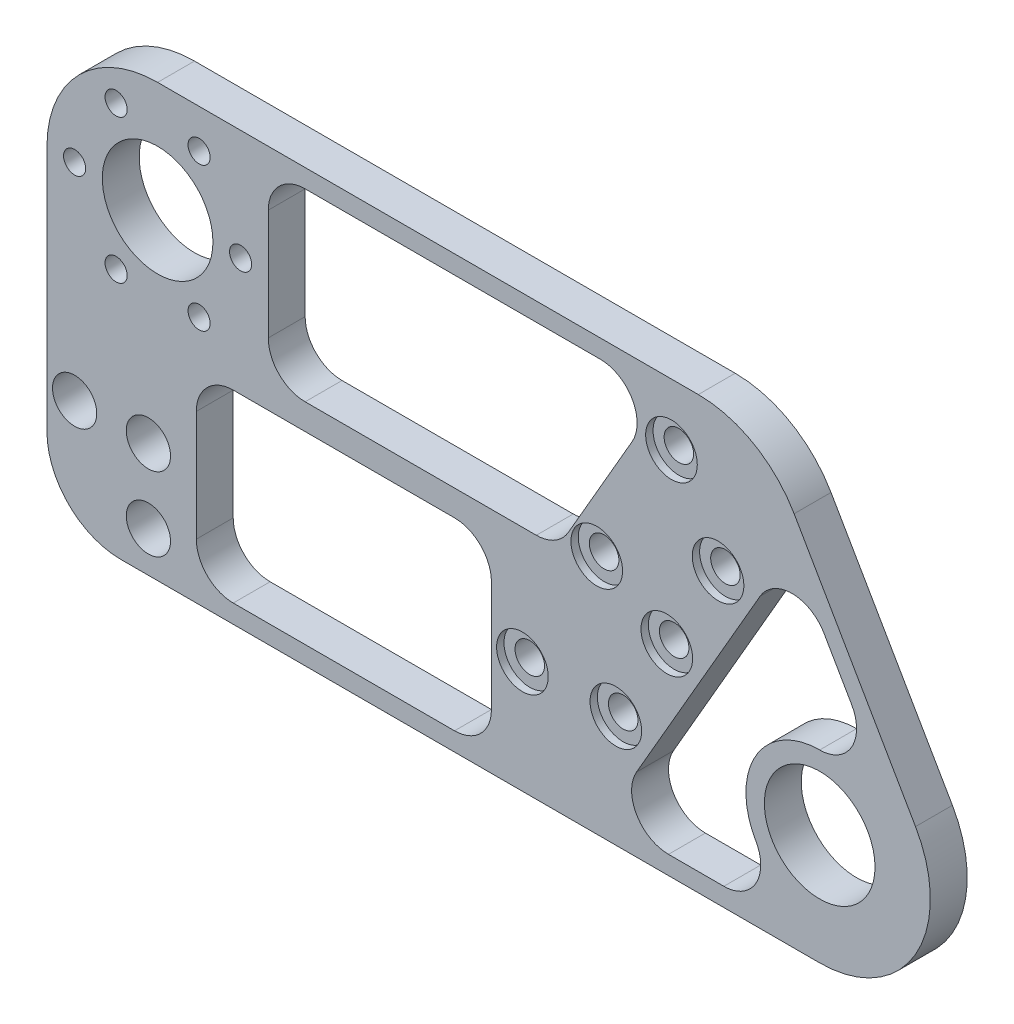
ISO-10303-21;
HEADER;
FILE_DESCRIPTION(('STEP AP214'),'2;1');
FILE_NAME('part.step','',(''),(''),'','','');
FILE_SCHEMA(('AUTOMOTIVE_DESIGN { 1 0 10303 214 1 1 1 1 }'));
ENDSEC;
DATA;
#1=APPLICATION_CONTEXT('core data for automotive mechanical design processes');
#2=APPLICATION_PROTOCOL_DEFINITION('international standard','automotive_design',2000,#1);
#3=PRODUCT_CONTEXT('',#1,'mechanical');
#4=PRODUCT('Part','Part','',(#3));
#5=PRODUCT_RELATED_PRODUCT_CATEGORY('part','',(#4));
#6=PRODUCT_DEFINITION_FORMATION('','',#4);
#7=PRODUCT_DEFINITION_CONTEXT('part definition',#1,'design');
#8=PRODUCT_DEFINITION('design','',#6,#7);
#9=PRODUCT_DEFINITION_SHAPE('','',#8);
#10=(LENGTH_UNIT() NAMED_UNIT(*) SI_UNIT(.MILLI.,.METRE.));
#11=(NAMED_UNIT(*) PLANE_ANGLE_UNIT() SI_UNIT($,.RADIAN.));
#12=(NAMED_UNIT(*) SI_UNIT($,.STERADIAN.) SOLID_ANGLE_UNIT());
#13=UNCERTAINTY_MEASURE_WITH_UNIT(LENGTH_MEASURE(1.E-05),#10,'distance_accuracy_value','');
#14=(GEOMETRIC_REPRESENTATION_CONTEXT(3) GLOBAL_UNCERTAINTY_ASSIGNED_CONTEXT((#13)) GLOBAL_UNIT_ASSIGNED_CONTEXT((#10,
#11,#12)) REPRESENTATION_CONTEXT('',''));
#15=CARTESIAN_POINT('',(0.,0.,0.));
#16=DIRECTION('',(0.,0.,1.));
#17=DIRECTION('',(1.,0.,0.));
#18=AXIS2_PLACEMENT_3D('',#15,#16,#17);
#19=CARTESIAN_POINT('',(128.901326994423,30.3990033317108,10.));
#20=DIRECTION('',(0.,0.,-1.));
#21=DIRECTION('',(-1.,0.,0.));
#22=AXIS2_PLACEMENT_3D('',#19,#20,#21);
#23=CYLINDRICAL_SURFACE('',#22,3.99999999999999);
#24=CARTESIAN_POINT('',(128.901326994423,30.3990033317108,0.));
#25=DIRECTION('',(0.,0.,1.));
#26=DIRECTION('',(1.,0.,0.));
#27=AXIS2_PLACEMENT_3D('',#24,#25,#26);
#28=CIRCLE('',#27,3.99999999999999);
#29=CARTESIAN_POINT('',(132.901326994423,30.3990033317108,0.));
#30=VERTEX_POINT('',#29);
#31=EDGE_CURVE('E606',#30,#30,#28,.T.);
#32=ORIENTED_EDGE('',*,*,#31,.F.);
#33=EDGE_LOOP('',(#32));
#34=FACE_BOUND('',#33,.T.);
#35=CARTESIAN_POINT('',(128.901326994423,30.3990033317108,8.));
#36=DIRECTION('',(0.,0.,1.));
#37=DIRECTION('',(1.,0.,0.));
#38=AXIS2_PLACEMENT_3D('',#35,#36,#37);
#39=CIRCLE('',#38,3.99999999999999);
#40=CARTESIAN_POINT('',(132.901326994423,30.3990033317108,8.));
#41=VERTEX_POINT('',#40);
#42=EDGE_CURVE('E37',#41,#41,#39,.T.);
#43=ORIENTED_EDGE('',*,*,#42,.T.);
#44=EDGE_LOOP('',(#43));
#45=FACE_BOUND('',#44,.T.);
#46=ADVANCED_FACE('F33',(#34,#45),#23,.F.);
#47=CARTESIAN_POINT('',(154.232338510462,30.2736022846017,10.));
#48=DIRECTION('',(0.,0.,-1.));
#49=DIRECTION('',(-1.,0.,0.));
#50=AXIS2_PLACEMENT_3D('',#47,#48,#49);
#51=CYLINDRICAL_SURFACE('',#50,3.99999999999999);
#52=CARTESIAN_POINT('',(154.232338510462,30.2736022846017,0.));
#53=DIRECTION('',(0.,0.,1.));
#54=DIRECTION('',(1.,0.,0.));
#55=AXIS2_PLACEMENT_3D('',#52,#53,#54);
#56=CIRCLE('',#55,3.99999999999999);
#57=CARTESIAN_POINT('',(158.232338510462,30.2736022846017,0.));
#58=VERTEX_POINT('',#57);
#59=EDGE_CURVE('E609',#58,#58,#56,.T.);
#60=ORIENTED_EDGE('',*,*,#59,.F.);
#61=EDGE_LOOP('',(#60));
#62=FACE_BOUND('',#61,.T.);
#63=CARTESIAN_POINT('',(154.232338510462,30.2736022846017,8.));
#64=DIRECTION('',(0.,0.,1.));
#65=DIRECTION('',(1.,0.,0.));
#66=AXIS2_PLACEMENT_3D('',#63,#64,#65);
#67=CIRCLE('',#66,3.99999999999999);
#68=CARTESIAN_POINT('',(158.232338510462,30.2736022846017,8.));
#69=VERTEX_POINT('',#68);
#70=EDGE_CURVE('E568',#69,#69,#67,.T.);
#71=ORIENTED_EDGE('',*,*,#70,.T.);
#72=EDGE_LOOP('',(#71));
#73=FACE_BOUND('',#72,.T.);
#74=ADVANCED_FACE('F728',(#62,#73),#51,.F.);
#75=CARTESIAN_POINT('',(168.049592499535,54.2057882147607,10.));
#76=DIRECTION('',(0.,0.,-1.));
#77=DIRECTION('',(-1.,0.,0.));
#78=AXIS2_PLACEMENT_3D('',#75,#76,#77);
#79=CYLINDRICAL_SURFACE('',#78,3.99999999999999);
#80=CARTESIAN_POINT('',(168.049592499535,54.2057882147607,0.));
#81=DIRECTION('',(0.,0.,1.));
#82=DIRECTION('',(1.,0.,0.));
#83=AXIS2_PLACEMENT_3D('',#80,#81,#82);
#84=CIRCLE('',#83,3.99999999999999);
#85=CARTESIAN_POINT('',(172.049592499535,54.2057882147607,0.));
#86=VERTEX_POINT('',#85);
#87=EDGE_CURVE('E612',#86,#86,#84,.T.);
#88=ORIENTED_EDGE('',*,*,#87,.F.);
#89=EDGE_LOOP('',(#88));
#90=FACE_BOUND('',#89,.T.);
#91=CARTESIAN_POINT('',(168.049592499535,54.2057882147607,8.));
#92=DIRECTION('',(0.,0.,1.));
#93=DIRECTION('',(1.,0.,0.));
#94=AXIS2_PLACEMENT_3D('',#91,#92,#93);
#95=CIRCLE('',#94,3.99999999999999);
#96=CARTESIAN_POINT('',(172.049592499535,54.2057882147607,8.));
#97=VERTEX_POINT('',#96);
#98=EDGE_CURVE('E564',#97,#97,#95,.T.);
#99=ORIENTED_EDGE('',*,*,#98,.T.);
#100=EDGE_LOOP('',(#99));
#101=FACE_BOUND('',#100,.T.);
#102=ADVANCED_FACE('F624',(#90,#101),#79,.F.);
#103=CARTESIAN_POINT('',(181.946056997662,78.275170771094,10.));
#104=DIRECTION('',(0.,0.,-1.));
#105=DIRECTION('',(-1.,0.,0.));
#106=AXIS2_PLACEMENT_3D('',#103,#104,#105);
#107=CYLINDRICAL_SURFACE('',#106,3.99999999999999);
#108=CARTESIAN_POINT('',(181.946056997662,78.275170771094,0.));
#109=DIRECTION('',(0.,0.,1.));
#110=DIRECTION('',(1.,0.,0.));
#111=AXIS2_PLACEMENT_3D('',#108,#109,#110);
#112=CIRCLE('',#111,3.99999999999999);
#113=CARTESIAN_POINT('',(185.946056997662,78.275170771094,0.));
#114=VERTEX_POINT('',#113);
#115=EDGE_CURVE('E282',#114,#114,#112,.T.);
#116=ORIENTED_EDGE('',*,*,#115,.F.);
#117=EDGE_LOOP('',(#116));
#118=FACE_BOUND('',#117,.T.);
#119=CARTESIAN_POINT('',(181.946056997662,78.275170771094,8.));
#120=DIRECTION('',(0.,0.,1.));
#121=DIRECTION('',(1.,0.,0.));
#122=AXIS2_PLACEMENT_3D('',#119,#120,#121);
#123=CIRCLE('',#122,3.99999999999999);
#124=CARTESIAN_POINT('',(185.946056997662,78.275170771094,8.));
#125=VERTEX_POINT('',#124);
#126=EDGE_CURVE('E559',#125,#125,#123,.T.);
#127=ORIENTED_EDGE('',*,*,#126,.T.);
#128=EDGE_LOOP('',(#127));
#129=FACE_BOUND('',#128,.T.);
#130=ADVANCED_FACE('F620',(#118,#129),#107,.F.);
#131=CARTESIAN_POINT('',(169.317166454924,100.401290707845,10.));
#132=DIRECTION('',(0.,0.,-1.));
#133=DIRECTION('',(-1.,0.,0.));
#134=AXIS2_PLACEMENT_3D('',#131,#132,#133);
#135=CYLINDRICAL_SURFACE('',#134,3.99999999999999);
#136=CARTESIAN_POINT('',(169.317166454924,100.401290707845,0.));
#137=DIRECTION('',(0.,0.,1.));
#138=DIRECTION('',(1.,0.,0.));
#139=AXIS2_PLACEMENT_3D('',#136,#137,#138);
#140=CIRCLE('',#139,3.99999999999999);
#141=CARTESIAN_POINT('',(173.317166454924,100.401290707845,0.));
#142=VERTEX_POINT('',#141);
#143=EDGE_CURVE('E552',#142,#142,#140,.T.);
#144=ORIENTED_EDGE('',*,*,#143,.F.);
#145=EDGE_LOOP('',(#144));
#146=FACE_BOUND('',#145,.T.);
#147=CARTESIAN_POINT('',(169.317166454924,100.401290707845,8.));
#148=DIRECTION('',(0.,0.,1.));
#149=DIRECTION('',(1.,0.,0.));
#150=AXIS2_PLACEMENT_3D('',#147,#148,#149);
#151=CIRCLE('',#150,3.99999999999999);
#152=CARTESIAN_POINT('',(173.317166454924,100.401290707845,8.));
#153=VERTEX_POINT('',#152);
#154=EDGE_CURVE('E554',#153,#153,#151,.T.);
#155=ORIENTED_EDGE('',*,*,#154,.T.);
#156=EDGE_LOOP('',(#155));
#157=FACE_BOUND('',#156,.T.);
#158=ADVANCED_FACE('F623',(#146,#157),#135,.F.);
#159=CARTESIAN_POINT('',(149.051489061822,65.3001078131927,10.));
#160=DIRECTION('',(0.,0.,-1.));
#161=DIRECTION('',(-1.,0.,0.));
#162=AXIS2_PLACEMENT_3D('',#159,#160,#161);
#163=CYLINDRICAL_SURFACE('',#162,3.99999999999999);
#164=CARTESIAN_POINT('',(149.051489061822,65.3001078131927,0.));
#165=DIRECTION('',(0.,0.,1.));
#166=DIRECTION('',(1.,0.,0.));
#167=AXIS2_PLACEMENT_3D('',#164,#165,#166);
#168=CIRCLE('',#167,3.99999999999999);
#169=CARTESIAN_POINT('',(153.051489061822,65.3001078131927,0.));
#170=VERTEX_POINT('',#169);
#171=EDGE_CURVE('E603',#170,#170,#168,.T.);
#172=ORIENTED_EDGE('',*,*,#171,.F.);
#173=EDGE_LOOP('',(#172));
#174=FACE_BOUND('',#173,.T.);
#175=CARTESIAN_POINT('',(149.051489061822,65.3001078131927,8.));
#176=DIRECTION('',(0.,0.,1.));
#177=DIRECTION('',(1.,0.,0.));
#178=AXIS2_PLACEMENT_3D('',#175,#176,#177);
#179=CIRCLE('',#178,3.99999999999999);
#180=CARTESIAN_POINT('',(153.051489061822,65.3001078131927,8.));
#181=VERTEX_POINT('',#180);
#182=EDGE_CURVE('E549',#181,#181,#179,.T.);
#183=ORIENTED_EDGE('',*,*,#182,.T.);
#184=EDGE_LOOP('',(#183));
#185=FACE_BOUND('',#184,.T.);
#186=ADVANCED_FACE('F644',(#174,#185),#163,.F.);
#187=CARTESIAN_POINT('',(209.5,30.,10.));
#188=DIRECTION('',(0.,0.,1.));
#189=DIRECTION('',(1.,0.,0.));
#190=AXIS2_PLACEMENT_3D('',#187,#188,#189);
#191=PLANE('',#190);
#192=CARTESIAN_POINT('',(128.901326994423,30.3990033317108,10.));
#193=DIRECTION('',(0.,0.,1.));
#194=DIRECTION('',(1.,0.,0.));
#195=AXIS2_PLACEMENT_3D('',#192,#193,#194);
#196=CIRCLE('',#195,7.00000000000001);
#197=CARTESIAN_POINT('',(135.901326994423,30.3990033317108,10.));
#198=VERTEX_POINT('',#197);
#199=EDGE_CURVE('E584',#198,#198,#196,.T.);
#200=ORIENTED_EDGE('',*,*,#199,.F.);
#201=EDGE_LOOP('',(#200));
#202=FACE_BOUND('',#201,.T.);
#203=CARTESIAN_POINT('',(154.232338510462,30.2736022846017,10.));
#204=DIRECTION('',(0.,0.,1.));
#205=DIRECTION('',(1.,0.,0.));
#206=AXIS2_PLACEMENT_3D('',#203,#204,#205);
#207=CIRCLE('',#206,7.00000000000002);
#208=CARTESIAN_POINT('',(161.232338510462,30.2736022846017,10.));
#209=VERTEX_POINT('',#208);
#210=EDGE_CURVE('E577',#209,#209,#207,.T.);
#211=ORIENTED_EDGE('',*,*,#210,.F.);
#212=EDGE_LOOP('',(#211));
#213=FACE_BOUND('',#212,.T.);
#214=CARTESIAN_POINT('',(168.049592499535,54.2057882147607,10.));
#215=DIRECTION('',(0.,0.,1.));
#216=DIRECTION('',(1.,0.,0.));
#217=AXIS2_PLACEMENT_3D('',#214,#215,#216);
#218=CIRCLE('',#217,7.00000000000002);
#219=CARTESIAN_POINT('',(175.049592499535,54.2057882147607,10.));
#220=VERTEX_POINT('',#219);
#221=EDGE_CURVE('E570',#220,#220,#218,.T.);
#222=ORIENTED_EDGE('',*,*,#221,.F.);
#223=EDGE_LOOP('',(#222));
#224=FACE_BOUND('',#223,.T.);
#225=CARTESIAN_POINT('',(181.946056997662,78.275170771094,10.));
#226=DIRECTION('',(0.,0.,1.));
#227=DIRECTION('',(1.,0.,0.));
#228=AXIS2_PLACEMENT_3D('',#225,#226,#227);
#229=CIRCLE('',#228,7.00000000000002);
#230=CARTESIAN_POINT('',(188.946056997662,78.275170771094,10.));
#231=VERTEX_POINT('',#230);
#232=EDGE_CURVE('E566',#231,#231,#229,.T.);
#233=ORIENTED_EDGE('',*,*,#232,.F.);
#234=EDGE_LOOP('',(#233));
#235=FACE_BOUND('',#234,.T.);
#236=CARTESIAN_POINT('',(169.317166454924,100.401290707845,10.));
#237=DIRECTION('',(0.,0.,1.));
#238=DIRECTION('',(1.,0.,0.));
#239=AXIS2_PLACEMENT_3D('',#236,#237,#238);
#240=CIRCLE('',#239,7.00000000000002);
#241=CARTESIAN_POINT('',(176.317166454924,100.401290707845,10.));
#242=VERTEX_POINT('',#241);
#243=EDGE_CURVE('E562',#242,#242,#240,.T.);
#244=ORIENTED_EDGE('',*,*,#243,.F.);
#245=EDGE_LOOP('',(#244));
#246=FACE_BOUND('',#245,.T.);
#247=CARTESIAN_POINT('',(149.051489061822,65.3001078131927,10.));
#248=DIRECTION('',(0.,0.,1.));
#249=DIRECTION('',(1.,0.,0.));
#250=AXIS2_PLACEMENT_3D('',#247,#248,#249);
#251=CIRCLE('',#250,7.00000000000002);
#252=CARTESIAN_POINT('',(156.051489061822,65.3001078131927,10.));
#253=VERTEX_POINT('',#252);
#254=EDGE_CURVE('E557',#253,#253,#251,.T.);
#255=ORIENTED_EDGE('',*,*,#254,.F.);
#256=EDGE_LOOP('',(#255));
#257=FACE_BOUND('',#256,.T.);
#258=CARTESIAN_POINT('',(209.5,30.,10.));
#259=DIRECTION('',(0.,0.,1.));
#260=DIRECTION('',(1.,0.,0.));
#261=AXIS2_PLACEMENT_3D('',#258,#259,#260);
#262=CIRCLE('',#261,15.);
#263=CARTESIAN_POINT('',(224.5,30.,10.));
#264=VERTEX_POINT('',#263);
#265=EDGE_CURVE('E312',#264,#264,#262,.T.);
#266=ORIENTED_EDGE('',*,*,#265,.F.);
#267=EDGE_LOOP('',(#266));
#268=FACE_BOUND('',#267,.T.);
#269=DIRECTION('',(-1.,0.,0.));
#270=VECTOR('',#269,1.);
#271=CARTESIAN_POINT('',(150.,112.,10.));
#272=LINE('',#271,#270);
#273=CARTESIAN_POINT('',(150.,112.,10.));
#274=VERTEX_POINT('',#273);
#275=CARTESIAN_POINT('',(70.0000000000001,112.,10.));
#276=VERTEX_POINT('',#275);
#277=EDGE_CURVE('E379',#274,#276,#272,.T.);
#278=ORIENTED_EDGE('',*,*,#277,.F.);
#279=CARTESIAN_POINT('',(150.,102.,10.));
#280=DIRECTION('',(0.,0.,1.));
#281=DIRECTION('',(1.,0.,0.));
#282=AXIS2_PLACEMENT_3D('',#279,#280,#281);
#283=CIRCLE('',#282,10.);
#284=CARTESIAN_POINT('',(158.660254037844,97.,10.));
#285=VERTEX_POINT('',#284);
#286=EDGE_CURVE('E377',#285,#274,#283,.T.);
#287=ORIENTED_EDGE('',*,*,#286,.F.);
#288=DIRECTION('',(0.499999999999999,0.866025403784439,0.));
#289=VECTOR('',#288,1.);
#290=CARTESIAN_POINT('',(141.339745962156,67.,10.));
#291=LINE('',#290,#289);
#292=CARTESIAN_POINT('',(141.339745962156,67.,10.));
#293=VERTEX_POINT('',#292);
#294=EDGE_CURVE('E393',#293,#285,#291,.T.);
#295=ORIENTED_EDGE('',*,*,#294,.F.);
#296=CARTESIAN_POINT('',(132.679491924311,72.,10.));
#297=DIRECTION('',(0.,0.,1.));
#298=DIRECTION('',(1.,0.,0.));
#299=AXIS2_PLACEMENT_3D('',#296,#297,#298);
#300=CIRCLE('',#299,10.);
#301=CARTESIAN_POINT('',(132.679491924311,62.,10.));
#302=VERTEX_POINT('',#301);
#303=EDGE_CURVE('E390',#302,#293,#300,.T.);
#304=ORIENTED_EDGE('',*,*,#303,.F.);
#305=DIRECTION('',(1.,0.,0.));
#306=VECTOR('',#305,1.);
#307=CARTESIAN_POINT('',(70.0000000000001,62.,10.));
#308=LINE('',#307,#306);
#309=CARTESIAN_POINT('',(70.0000000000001,62.,10.));
#310=VERTEX_POINT('',#309);
#311=EDGE_CURVE('E388',#310,#302,#308,.T.);
#312=ORIENTED_EDGE('',*,*,#311,.F.);
#313=CARTESIAN_POINT('',(70.,72.,10.));
#314=DIRECTION('',(0.,0.,1.));
#315=DIRECTION('',(1.,0.,0.));
#316=AXIS2_PLACEMENT_3D('',#313,#314,#315);
#317=CIRCLE('',#316,10.);
#318=CARTESIAN_POINT('',(60.,72.0000000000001,10.));
#319=VERTEX_POINT('',#318);
#320=EDGE_CURVE('E386',#319,#310,#317,.T.);
#321=ORIENTED_EDGE('',*,*,#320,.F.);
#322=DIRECTION('',(0.,-1.,0.));
#323=VECTOR('',#322,1.);
#324=CARTESIAN_POINT('',(60.,102.,10.));
#325=LINE('',#324,#323);
#326=CARTESIAN_POINT('',(60.,102.,10.));
#327=VERTEX_POINT('',#326);
#328=EDGE_CURVE('E384',#327,#319,#325,.T.);
#329=ORIENTED_EDGE('',*,*,#328,.F.);
#330=CARTESIAN_POINT('',(70.,102.,10.));
#331=DIRECTION('',(0.,0.,1.));
#332=DIRECTION('',(-1.,0.,0.));
#333=AXIS2_PLACEMENT_3D('',#330,#331,#332);
#334=CIRCLE('',#333,10.);
#335=EDGE_CURVE('E382',#276,#327,#334,.T.);
#336=ORIENTED_EDGE('',*,*,#335,.F.);
#337=EDGE_LOOP('',(#278,#287,#295,#304,#312,#321,#329,#336));
#338=FACE_BOUND('',#337,.T.);
#339=CARTESIAN_POINT('',(27.5,31.,10.));
#340=DIRECTION('',(0.,0.,1.));
#341=DIRECTION('',(1.,0.,0.));
#342=AXIS2_PLACEMENT_3D('',#339,#340,#341);
#343=CIRCLE('',#342,6.);
#344=CARTESIAN_POINT('',(33.5,31.,10.));
#345=VERTEX_POINT('',#344);
#346=EDGE_CURVE('E442',#345,#345,#343,.T.);
#347=ORIENTED_EDGE('',*,*,#346,.F.);
#348=EDGE_LOOP('',(#347));
#349=FACE_BOUND('',#348,.T.);
#350=CARTESIAN_POINT('',(18.7499999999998,106.48557158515,10.));
#351=DIRECTION('',(0.,0.,1.));
#352=DIRECTION('',(1.,0.,0.));
#353=AXIS2_PLACEMENT_3D('',#350,#351,#352);
#354=CIRCLE('',#353,3.);
#355=CARTESIAN_POINT('',(21.7499999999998,106.48557158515,10.));
#356=VERTEX_POINT('',#355);
#357=EDGE_CURVE('E454',#356,#356,#354,.T.);
#358=ORIENTED_EDGE('',*,*,#357,.F.);
#359=EDGE_LOOP('',(#358));
#360=FACE_BOUND('',#359,.T.);
#361=CARTESIAN_POINT('',(52.5,87.,10.));
#362=DIRECTION('',(0.,0.,1.));
#363=DIRECTION('',(1.,0.,0.));
#364=AXIS2_PLACEMENT_3D('',#361,#362,#363);
#365=CIRCLE('',#364,3.);
#366=CARTESIAN_POINT('',(55.5,87.,10.));
#367=VERTEX_POINT('',#366);
#368=EDGE_CURVE('E466',#367,#367,#365,.T.);
#369=ORIENTED_EDGE('',*,*,#368,.F.);
#370=EDGE_LOOP('',(#369));
#371=FACE_BOUND('',#370,.T.);
#372=CARTESIAN_POINT('',(18.7500000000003,67.51442841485,10.));
#373=DIRECTION('',(0.,0.,1.));
#374=DIRECTION('',(1.,0.,0.));
#375=AXIS2_PLACEMENT_3D('',#372,#373,#374);
#376=CIRCLE('',#375,3.00000000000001);
#377=CARTESIAN_POINT('',(21.7500000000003,67.51442841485,10.));
#378=VERTEX_POINT('',#377);
#379=EDGE_CURVE('E478',#378,#378,#376,.T.);
#380=ORIENTED_EDGE('',*,*,#379,.F.);
#381=EDGE_LOOP('',(#380));
#382=FACE_BOUND('',#381,.T.);
#383=CARTESIAN_POINT('',(30.,87.,10.));
#384=DIRECTION('',(0.,0.,1.));
#385=DIRECTION('',(1.,0.,0.));
#386=AXIS2_PLACEMENT_3D('',#383,#384,#385);
#387=CIRCLE('',#386,15.);
#388=CARTESIAN_POINT('',(45.,87.,10.));
#389=VERTEX_POINT('',#388);
#390=EDGE_CURVE('E490',#389,#389,#387,.T.);
#391=ORIENTED_EDGE('',*,*,#390,.F.);
#392=EDGE_LOOP('',(#391));
#393=FACE_BOUND('',#392,.T.);
#394=CARTESIAN_POINT('',(209.5,30.,10.));
#395=DIRECTION('',(0.,0.,1.));
#396=DIRECTION('',(1.,0.,0.));
#397=AXIS2_PLACEMENT_3D('',#394,#395,#396);
#398=CIRCLE('',#397,30.);
#399=CARTESIAN_POINT('',(209.5,0.,10.));
#400=VERTEX_POINT('',#399);
#401=CARTESIAN_POINT('',(235.480762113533,45.0000000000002,10.));
#402=VERTEX_POINT('',#401);
#403=EDGE_CURVE('E496',#400,#402,#398,.T.);
#404=ORIENTED_EDGE('',*,*,#403,.T.);
#405=DIRECTION('',(-0.500000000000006,0.866025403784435,0.));
#406=VECTOR('',#405,1.);
#407=CARTESIAN_POINT('',(235.480762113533,45.0000000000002,10.));
#408=LINE('',#407,#406);
#409=CARTESIAN_POINT('',(202.571796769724,102.,10.));
#410=VERTEX_POINT('',#409);
#411=EDGE_CURVE('E499',#402,#410,#408,.T.);
#412=ORIENTED_EDGE('',*,*,#411,.T.);
#413=CARTESIAN_POINT('',(176.591034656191,87.,10.));
#414=DIRECTION('',(0.,0.,1.));
#415=DIRECTION('',(1.,0.,0.));
#416=AXIS2_PLACEMENT_3D('',#413,#414,#415);
#417=CIRCLE('',#416,30.);
#418=CARTESIAN_POINT('',(176.591034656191,117.,10.));
#419=VERTEX_POINT('',#418);
#420=EDGE_CURVE('E502',#410,#419,#417,.T.);
#421=ORIENTED_EDGE('',*,*,#420,.T.);
#422=DIRECTION('',(-1.,0.,0.));
#423=VECTOR('',#422,1.);
#424=CARTESIAN_POINT('',(176.591034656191,117.,10.));
#425=LINE('',#424,#423);
#426=CARTESIAN_POINT('',(30.,117.,10.));
#427=VERTEX_POINT('',#426);
#428=EDGE_CURVE('E504',#419,#427,#425,.T.);
#429=ORIENTED_EDGE('',*,*,#428,.T.);
#430=CARTESIAN_POINT('',(30.,87.,10.));
#431=DIRECTION('',(0.,0.,1.));
#432=DIRECTION('',(1.,0.,0.));
#433=AXIS2_PLACEMENT_3D('',#430,#431,#432);
#434=CIRCLE('',#433,30.);
#435=CARTESIAN_POINT('',(0.,87.,10.));
#436=VERTEX_POINT('',#435);
#437=EDGE_CURVE('E506',#427,#436,#434,.T.);
#438=ORIENTED_EDGE('',*,*,#437,.T.);
#439=DIRECTION('',(0.,-1.,0.));
#440=VECTOR('',#439,1.);
#441=CARTESIAN_POINT('',(0.,87.,10.));
#442=LINE('',#441,#440);
#443=CARTESIAN_POINT('',(0.,20.,10.));
#444=VERTEX_POINT('',#443);
#445=EDGE_CURVE('E508',#436,#444,#442,.T.);
#446=ORIENTED_EDGE('',*,*,#445,.T.);
#447=CARTESIAN_POINT('',(20.,20.,10.));
#448=DIRECTION('',(0.,0.,1.));
#449=DIRECTION('',(-1.,0.,0.));
#450=AXIS2_PLACEMENT_3D('',#447,#448,#449);
#451=CIRCLE('',#450,20.);
#452=CARTESIAN_POINT('',(20.,0.,10.));
#453=VERTEX_POINT('',#452);
#454=EDGE_CURVE('E510',#444,#453,#451,.T.);
#455=ORIENTED_EDGE('',*,*,#454,.T.);
#456=DIRECTION('',(1.,0.,0.));
#457=VECTOR('',#456,1.);
#458=CARTESIAN_POINT('',(20.,0.,10.));
#459=LINE('',#458,#457);
#460=EDGE_CURVE('E512',#453,#400,#459,.T.);
#461=ORIENTED_EDGE('',*,*,#460,.T.);
#462=EDGE_LOOP('',(#404,#412,#421,#429,#438,#446,#455,#461));
#463=FACE_BOUND('',#462,.T.);
#464=CARTESIAN_POINT('',(7.5,87.,10.));
#465=DIRECTION('',(0.,0.,1.));
#466=DIRECTION('',(1.,0.,0.));
#467=AXIS2_PLACEMENT_3D('',#464,#465,#466);
#468=CIRCLE('',#467,3.);
#469=CARTESIAN_POINT('',(10.5,87.,10.));
#470=VERTEX_POINT('',#469);
#471=EDGE_CURVE('E484',#470,#470,#468,.T.);
#472=ORIENTED_EDGE('',*,*,#471,.F.);
#473=EDGE_LOOP('',(#472));
#474=FACE_BOUND('',#473,.T.);
#475=CARTESIAN_POINT('',(41.2500000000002,67.5144284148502,10.));
#476=DIRECTION('',(0.,0.,1.));
#477=DIRECTION('',(1.,0.,0.));
#478=AXIS2_PLACEMENT_3D('',#475,#476,#477);
#479=CIRCLE('',#478,3.);
#480=CARTESIAN_POINT('',(44.2500000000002,67.5144284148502,10.));
#481=VERTEX_POINT('',#480);
#482=EDGE_CURVE('E472',#481,#481,#479,.T.);
#483=ORIENTED_EDGE('',*,*,#482,.F.);
#484=EDGE_LOOP('',(#483));
#485=FACE_BOUND('',#484,.T.);
#486=CARTESIAN_POINT('',(41.2499999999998,106.48557158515,10.));
#487=DIRECTION('',(0.,0.,1.));
#488=DIRECTION('',(1.,0.,0.));
#489=AXIS2_PLACEMENT_3D('',#486,#487,#488);
#490=CIRCLE('',#489,3.00000000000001);
#491=CARTESIAN_POINT('',(44.2499999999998,106.48557158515,10.));
#492=VERTEX_POINT('',#491);
#493=EDGE_CURVE('E460',#492,#492,#490,.T.);
#494=ORIENTED_EDGE('',*,*,#493,.F.);
#495=EDGE_LOOP('',(#494));
#496=FACE_BOUND('',#495,.T.);
#497=CARTESIAN_POINT('',(7.50000000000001,31.,10.));
#498=DIRECTION('',(0.,0.,1.));
#499=DIRECTION('',(1.,0.,0.));
#500=AXIS2_PLACEMENT_3D('',#497,#498,#499);
#501=CIRCLE('',#500,6.);
#502=CARTESIAN_POINT('',(13.5,31.,10.));
#503=VERTEX_POINT('',#502);
#504=EDGE_CURVE('E448',#503,#503,#501,.T.);
#505=ORIENTED_EDGE('',*,*,#504,.F.);
#506=EDGE_LOOP('',(#505));
#507=FACE_BOUND('',#506,.T.);
#508=CARTESIAN_POINT('',(27.5,11.,10.));
#509=DIRECTION('',(0.,0.,1.));
#510=DIRECTION('',(1.,0.,0.));
#511=AXIS2_PLACEMENT_3D('',#508,#509,#510);
#512=CIRCLE('',#511,6.00000000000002);
#513=CARTESIAN_POINT('',(33.5,11.,10.));
#514=VERTEX_POINT('',#513);
#515=EDGE_CURVE('E436',#514,#514,#512,.T.);
#516=ORIENTED_EDGE('',*,*,#515,.F.);
#517=EDGE_LOOP('',(#516));
#518=FACE_BOUND('',#517,.T.);
#519=DIRECTION('',(-1.,0.,0.));
#520=VECTOR('',#519,1.);
#521=CARTESIAN_POINT('',(50.5,55.,10.));
#522=LINE('',#521,#520);
#523=CARTESIAN_POINT('',(110.5,55.,10.));
#524=VERTEX_POINT('',#523);
#525=CARTESIAN_POINT('',(50.5,55.,10.));
#526=VERTEX_POINT('',#525);
#527=EDGE_CURVE('E320',#524,#526,#522,.T.);
#528=ORIENTED_EDGE('',*,*,#527,.F.);
#529=CARTESIAN_POINT('',(110.5,45.,10.));
#530=DIRECTION('',(0.,0.,1.));
#531=DIRECTION('',(-1.,0.,0.));
#532=AXIS2_PLACEMENT_3D('',#529,#530,#531);
#533=CIRCLE('',#532,10.);
#534=CARTESIAN_POINT('',(120.5,45.,10.));
#535=VERTEX_POINT('',#534);
#536=EDGE_CURVE('E318',#535,#524,#533,.T.);
#537=ORIENTED_EDGE('',*,*,#536,.F.);
#538=DIRECTION('',(0.,1.,0.));
#539=VECTOR('',#538,1.);
#540=CARTESIAN_POINT('',(120.5,45.,10.));
#541=LINE('',#540,#539);
#542=CARTESIAN_POINT('',(120.5,15.,10.));
#543=VERTEX_POINT('',#542);
#544=EDGE_CURVE('E334',#543,#535,#541,.T.);
#545=ORIENTED_EDGE('',*,*,#544,.F.);
#546=CARTESIAN_POINT('',(110.5,15.,10.));
#547=DIRECTION('',(0.,0.,1.));
#548=DIRECTION('',(1.,0.,0.));
#549=AXIS2_PLACEMENT_3D('',#546,#547,#548);
#550=CIRCLE('',#549,10.);
#551=CARTESIAN_POINT('',(110.5,5.,10.));
#552=VERTEX_POINT('',#551);
#553=EDGE_CURVE('E331',#552,#543,#550,.T.);
#554=ORIENTED_EDGE('',*,*,#553,.F.);
#555=DIRECTION('',(1.,0.,0.));
#556=VECTOR('',#555,1.);
#557=CARTESIAN_POINT('',(50.5,5.,10.));
#558=LINE('',#557,#556);
#559=CARTESIAN_POINT('',(50.5,5.,10.));
#560=VERTEX_POINT('',#559);
#561=EDGE_CURVE('E329',#560,#552,#558,.T.);
#562=ORIENTED_EDGE('',*,*,#561,.F.);
#563=CARTESIAN_POINT('',(50.5,15.,10.));
#564=DIRECTION('',(0.,0.,1.));
#565=DIRECTION('',(1.,0.,0.));
#566=AXIS2_PLACEMENT_3D('',#563,#564,#565);
#567=CIRCLE('',#566,10.);
#568=CARTESIAN_POINT('',(40.5,15.,10.));
#569=VERTEX_POINT('',#568);
#570=EDGE_CURVE('E327',#569,#560,#567,.T.);
#571=ORIENTED_EDGE('',*,*,#570,.F.);
#572=DIRECTION('',(0.,-1.,0.));
#573=VECTOR('',#572,1.);
#574=CARTESIAN_POINT('',(40.5,45.,10.));
#575=LINE('',#574,#573);
#576=CARTESIAN_POINT('',(40.5,45.,10.));
#577=VERTEX_POINT('',#576);
#578=EDGE_CURVE('E325',#577,#569,#575,.T.);
#579=ORIENTED_EDGE('',*,*,#578,.F.);
#580=CARTESIAN_POINT('',(50.5,45.,10.));
#581=DIRECTION('',(0.,0.,1.));
#582=DIRECTION('',(1.,0.,0.));
#583=AXIS2_PLACEMENT_3D('',#580,#581,#582);
#584=CIRCLE('',#583,10.);
#585=EDGE_CURVE('E323',#526,#577,#584,.T.);
#586=ORIENTED_EDGE('',*,*,#585,.F.);
#587=EDGE_LOOP('',(#528,#537,#545,#554,#562,#571,#579,#586));
#588=FACE_BOUND('',#587,.T.);
#589=CARTESIAN_POINT('',(209.5,30.,10.));
#590=DIRECTION('',(0.,0.,-1.));
#591=DIRECTION('',(1.,0.,0.));
#592=AXIS2_PLACEMENT_3D('',#589,#590,#591);
#593=CIRCLE('',#592,20.);
#594=CARTESIAN_POINT('',(192.179491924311,20.,10.));
#595=VERTEX_POINT('',#594);
#596=CARTESIAN_POINT('',(209.5,50.,10.));
#597=VERTEX_POINT('',#596);
#598=EDGE_CURVE('E252',#595,#597,#593,.T.);
#599=ORIENTED_EDGE('',*,*,#598,.F.);
#600=CARTESIAN_POINT('',(183.519237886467,15.,10.));
#601=DIRECTION('',(0.,0.,1.));
#602=DIRECTION('',(-1.,0.,0.));
#603=AXIS2_PLACEMENT_3D('',#600,#601,#602);
#604=CIRCLE('',#603,9.99999999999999);
#605=CARTESIAN_POINT('',(183.519237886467,5.,10.));
#606=VERTEX_POINT('',#605);
#607=EDGE_CURVE('E244',#606,#595,#604,.T.);
#608=ORIENTED_EDGE('',*,*,#607,.F.);
#609=DIRECTION('',(1.,0.,0.));
#610=VECTOR('',#609,1.);
#611=CARTESIAN_POINT('',(183.519237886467,5.,10.));
#612=LINE('',#611,#610);
#613=CARTESIAN_POINT('',(168.508130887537,5.,10.));
#614=VERTEX_POINT('',#613);
#615=EDGE_CURVE('E279',#614,#606,#612,.T.);
#616=ORIENTED_EDGE('',*,*,#615,.F.);
#617=CARTESIAN_POINT('',(168.508130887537,15.,10.));
#618=DIRECTION('',(0.,0.,1.));
#619=DIRECTION('',(-1.,0.,0.));
#620=AXIS2_PLACEMENT_3D('',#617,#618,#619);
#621=CIRCLE('',#620,10.);
#622=CARTESIAN_POINT('',(159.847876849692,20.0000000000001,10.));
#623=VERTEX_POINT('',#622);
#624=EDGE_CURVE('E277',#623,#614,#621,.T.);
#625=ORIENTED_EDGE('',*,*,#624,.F.);
#626=DIRECTION('',(-0.499999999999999,-0.866025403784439,0.));
#627=VECTOR('',#626,1.);
#628=CARTESIAN_POINT('',(159.847876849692,20.0000000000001,10.));
#629=LINE('',#628,#627);
#630=CARTESIAN_POINT('',(193.33419246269,77.9999999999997,10.));
#631=VERTEX_POINT('',#630);
#632=EDGE_CURVE('E275',#631,#623,#629,.T.);
#633=ORIENTED_EDGE('',*,*,#632,.F.);
#634=CARTESIAN_POINT('',(201.994446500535,72.9999999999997,10.));
#635=DIRECTION('',(0.,0.,1.));
#636=DIRECTION('',(-1.,0.,0.));
#637=AXIS2_PLACEMENT_3D('',#634,#635,#636);
#638=CIRCLE('',#637,10.);
#639=CARTESIAN_POINT('',(210.654700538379,77.9999999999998,10.));
#640=VERTEX_POINT('',#639);
#641=EDGE_CURVE('E273',#640,#631,#638,.T.);
#642=ORIENTED_EDGE('',*,*,#641,.F.);
#643=DIRECTION('',(-0.500000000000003,0.866025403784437,0.));
#644=VECTOR('',#643,1.);
#645=CARTESIAN_POINT('',(210.654700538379,77.9999999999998,10.));
#646=LINE('',#645,#644);
#647=CARTESIAN_POINT('',(218.160254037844,65.0000000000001,10.));
#648=VERTEX_POINT('',#647);
#649=EDGE_CURVE('E268',#648,#640,#646,.T.);
#650=ORIENTED_EDGE('',*,*,#649,.F.);
#651=CARTESIAN_POINT('',(209.5,60.,10.));
#652=DIRECTION('',(0.,0.,1.));
#653=DIRECTION('',(-1.,0.,0.));
#654=AXIS2_PLACEMENT_3D('',#651,#652,#653);
#655=CIRCLE('',#654,10.);
#656=EDGE_CURVE('E266',#597,#648,#655,.T.);
#657=ORIENTED_EDGE('',*,*,#656,.F.);
#658=EDGE_LOOP('',(#599,#608,#616,#625,#633,#642,#650,#657));
#659=FACE_BOUND('',#658,.T.);
#660=ADVANCED_FACE('F264',(#202,#213,#224,#235,#246,#257,#268,#338,#349,#360,#371,#382,#393,
#463,#474,#485,#496,#507,#518,#588,#659),#191,.T.);
#661=CARTESIAN_POINT('',(209.5,30.,0.));
#662=DIRECTION('',(0.,0.,1.));
#663=DIRECTION('',(1.,0.,0.));
#664=AXIS2_PLACEMENT_3D('',#661,#662,#663);
#665=PLANE('',#664);
#666=ORIENTED_EDGE('',*,*,#171,.T.);
#667=EDGE_LOOP('',(#666));
#668=FACE_BOUND('',#667,.T.);
#669=ORIENTED_EDGE('',*,*,#59,.T.);
#670=EDGE_LOOP('',(#669));
#671=FACE_BOUND('',#670,.T.);
#672=ORIENTED_EDGE('',*,*,#115,.T.);
#673=EDGE_LOOP('',(#672));
#674=FACE_BOUND('',#673,.T.);
#675=CARTESIAN_POINT('',(209.5,30.,0.));
#676=DIRECTION('',(0.,0.,1.));
#677=DIRECTION('',(1.,0.,0.));
#678=AXIS2_PLACEMENT_3D('',#675,#676,#677);
#679=CIRCLE('',#678,15.);
#680=CARTESIAN_POINT('',(224.5,30.,0.));
#681=VERTEX_POINT('',#680);
#682=EDGE_CURVE('E260',#681,#681,#679,.T.);
#683=ORIENTED_EDGE('',*,*,#682,.T.);
#684=EDGE_LOOP('',(#683));
#685=FACE_BOUND('',#684,.T.);
#686=CARTESIAN_POINT('',(150.,102.,0.));
#687=DIRECTION('',(0.,0.,1.));
#688=DIRECTION('',(1.,0.,0.));
#689=AXIS2_PLACEMENT_3D('',#686,#687,#688);
#690=CIRCLE('',#689,10.);
#691=CARTESIAN_POINT('',(158.660254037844,97.,0.));
#692=VERTEX_POINT('',#691);
#693=CARTESIAN_POINT('',(150.,112.,0.));
#694=VERTEX_POINT('',#693);
#695=EDGE_CURVE('E376',#692,#694,#690,.T.);
#696=ORIENTED_EDGE('',*,*,#695,.T.);
#697=DIRECTION('',(-1.,0.,0.));
#698=VECTOR('',#697,1.);
#699=CARTESIAN_POINT('',(150.,112.,0.));
#700=LINE('',#699,#698);
#701=CARTESIAN_POINT('',(70.0000000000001,112.,0.));
#702=VERTEX_POINT('',#701);
#703=EDGE_CURVE('E398',#694,#702,#700,.T.);
#704=ORIENTED_EDGE('',*,*,#703,.T.);
#705=CARTESIAN_POINT('',(70.,102.,0.));
#706=DIRECTION('',(0.,0.,1.));
#707=DIRECTION('',(-1.,0.,0.));
#708=AXIS2_PLACEMENT_3D('',#705,#706,#707);
#709=CIRCLE('',#708,10.);
#710=CARTESIAN_POINT('',(60.,102.,0.));
#711=VERTEX_POINT('',#710);
#712=EDGE_CURVE('E401',#702,#711,#709,.T.);
#713=ORIENTED_EDGE('',*,*,#712,.T.);
#714=DIRECTION('',(0.,-1.,0.));
#715=VECTOR('',#714,1.);
#716=CARTESIAN_POINT('',(60.,102.,0.));
#717=LINE('',#716,#715);
#718=CARTESIAN_POINT('',(60.,72.0000000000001,0.));
#719=VERTEX_POINT('',#718);
#720=EDGE_CURVE('E404',#711,#719,#717,.T.);
#721=ORIENTED_EDGE('',*,*,#720,.T.);
#722=CARTESIAN_POINT('',(70.,72.,0.));
#723=DIRECTION('',(0.,0.,1.));
#724=DIRECTION('',(1.,0.,0.));
#725=AXIS2_PLACEMENT_3D('',#722,#723,#724);
#726=CIRCLE('',#725,10.);
#727=CARTESIAN_POINT('',(70.0000000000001,62.,0.));
#728=VERTEX_POINT('',#727);
#729=EDGE_CURVE('E407',#719,#728,#726,.T.);
#730=ORIENTED_EDGE('',*,*,#729,.T.);
#731=DIRECTION('',(1.,0.,0.));
#732=VECTOR('',#731,1.);
#733=CARTESIAN_POINT('',(70.0000000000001,62.,0.));
#734=LINE('',#733,#732);
#735=CARTESIAN_POINT('',(132.679491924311,62.,0.));
#736=VERTEX_POINT('',#735);
#737=EDGE_CURVE('E410',#728,#736,#734,.T.);
#738=ORIENTED_EDGE('',*,*,#737,.T.);
#739=CARTESIAN_POINT('',(132.679491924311,72.,0.));
#740=DIRECTION('',(0.,0.,1.));
#741=DIRECTION('',(1.,0.,0.));
#742=AXIS2_PLACEMENT_3D('',#739,#740,#741);
#743=CIRCLE('',#742,10.);
#744=CARTESIAN_POINT('',(141.339745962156,67.,0.));
#745=VERTEX_POINT('',#744);
#746=EDGE_CURVE('E413',#736,#745,#743,.T.);
#747=ORIENTED_EDGE('',*,*,#746,.T.);
#748=DIRECTION('',(0.499999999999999,0.866025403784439,0.));
#749=VECTOR('',#748,1.);
#750=CARTESIAN_POINT('',(141.339745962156,67.,0.));
#751=LINE('',#750,#749);
#752=EDGE_CURVE('E380',#745,#692,#751,.T.);
#753=ORIENTED_EDGE('',*,*,#752,.T.);
#754=EDGE_LOOP('',(#696,#704,#713,#721,#730,#738,#747,#753));
#755=FACE_BOUND('',#754,.T.);
#756=CARTESIAN_POINT('',(27.5,31.,0.));
#757=DIRECTION('',(0.,0.,1.));
#758=DIRECTION('',(1.,0.,0.));
#759=AXIS2_PLACEMENT_3D('',#756,#757,#758);
#760=CIRCLE('',#759,6.);
#761=CARTESIAN_POINT('',(33.5,31.,0.));
#762=VERTEX_POINT('',#761);
#763=EDGE_CURVE('E439',#762,#762,#760,.T.);
#764=ORIENTED_EDGE('',*,*,#763,.T.);
#765=EDGE_LOOP('',(#764));
#766=FACE_BOUND('',#765,.T.);
#767=CARTESIAN_POINT('',(18.7499999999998,106.48557158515,0.));
#768=DIRECTION('',(0.,0.,1.));
#769=DIRECTION('',(1.,0.,0.));
#770=AXIS2_PLACEMENT_3D('',#767,#768,#769);
#771=CIRCLE('',#770,3.);
#772=CARTESIAN_POINT('',(21.7499999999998,106.48557158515,0.));
#773=VERTEX_POINT('',#772);
#774=EDGE_CURVE('E451',#773,#773,#771,.T.);
#775=ORIENTED_EDGE('',*,*,#774,.T.);
#776=EDGE_LOOP('',(#775));
#777=FACE_BOUND('',#776,.T.);
#778=CARTESIAN_POINT('',(52.5,87.,0.));
#779=DIRECTION('',(0.,0.,1.));
#780=DIRECTION('',(1.,0.,0.));
#781=AXIS2_PLACEMENT_3D('',#778,#779,#780);
#782=CIRCLE('',#781,3.);
#783=CARTESIAN_POINT('',(55.5,87.,0.));
#784=VERTEX_POINT('',#783);
#785=EDGE_CURVE('E463',#784,#784,#782,.T.);
#786=ORIENTED_EDGE('',*,*,#785,.T.);
#787=EDGE_LOOP('',(#786));
#788=FACE_BOUND('',#787,.T.);
#789=CARTESIAN_POINT('',(18.7500000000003,67.51442841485,0.));
#790=DIRECTION('',(0.,0.,1.));
#791=DIRECTION('',(1.,0.,0.));
#792=AXIS2_PLACEMENT_3D('',#789,#790,#791);
#793=CIRCLE('',#792,3.00000000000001);
#794=CARTESIAN_POINT('',(21.7500000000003,67.51442841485,0.));
#795=VERTEX_POINT('',#794);
#796=EDGE_CURVE('E475',#795,#795,#793,.T.);
#797=ORIENTED_EDGE('',*,*,#796,.T.);
#798=EDGE_LOOP('',(#797));
#799=FACE_BOUND('',#798,.T.);
#800=CARTESIAN_POINT('',(30.,87.,0.));
#801=DIRECTION('',(0.,0.,1.));
#802=DIRECTION('',(1.,0.,0.));
#803=AXIS2_PLACEMENT_3D('',#800,#801,#802);
#804=CIRCLE('',#803,15.);
#805=CARTESIAN_POINT('',(45.,87.,0.));
#806=VERTEX_POINT('',#805);
#807=EDGE_CURVE('E487',#806,#806,#804,.T.);
#808=ORIENTED_EDGE('',*,*,#807,.T.);
#809=EDGE_LOOP('',(#808));
#810=FACE_BOUND('',#809,.T.);
#811=CARTESIAN_POINT('',(209.5,30.,0.));
#812=DIRECTION('',(0.,0.,1.));
#813=DIRECTION('',(1.,0.,0.));
#814=AXIS2_PLACEMENT_3D('',#811,#812,#813);
#815=CIRCLE('',#814,30.);
#816=CARTESIAN_POINT('',(209.5,0.,0.));
#817=VERTEX_POINT('',#816);
#818=CARTESIAN_POINT('',(235.480762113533,45.0000000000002,0.));
#819=VERTEX_POINT('',#818);
#820=EDGE_CURVE('E493',#817,#819,#815,.T.);
#821=ORIENTED_EDGE('',*,*,#820,.F.);
#822=DIRECTION('',(1.,0.,0.));
#823=VECTOR('',#822,1.);
#824=CARTESIAN_POINT('',(20.,0.,0.));
#825=LINE('',#824,#823);
#826=CARTESIAN_POINT('',(20.,0.,0.));
#827=VERTEX_POINT('',#826);
#828=EDGE_CURVE('E500',#827,#817,#825,.T.);
#829=ORIENTED_EDGE('',*,*,#828,.F.);
#830=CARTESIAN_POINT('',(20.,20.,0.));
#831=DIRECTION('',(0.,0.,1.));
#832=DIRECTION('',(-1.,0.,0.));
#833=AXIS2_PLACEMENT_3D('',#830,#831,#832);
#834=CIRCLE('',#833,20.);
#835=CARTESIAN_POINT('',(0.,20.,0.));
#836=VERTEX_POINT('',#835);
#837=EDGE_CURVE('E527',#836,#827,#834,.T.);
#838=ORIENTED_EDGE('',*,*,#837,.F.);
#839=DIRECTION('',(0.,-1.,0.));
#840=VECTOR('',#839,1.);
#841=CARTESIAN_POINT('',(0.,87.,0.));
#842=LINE('',#841,#840);
#843=CARTESIAN_POINT('',(0.,87.,0.));
#844=VERTEX_POINT('',#843);
#845=EDGE_CURVE('E525',#844,#836,#842,.T.);
#846=ORIENTED_EDGE('',*,*,#845,.F.);
#847=CARTESIAN_POINT('',(30.,87.,0.));
#848=DIRECTION('',(0.,0.,1.));
#849=DIRECTION('',(1.,0.,0.));
#850=AXIS2_PLACEMENT_3D('',#847,#848,#849);
#851=CIRCLE('',#850,30.);
#852=CARTESIAN_POINT('',(30.,117.,0.));
#853=VERTEX_POINT('',#852);
#854=EDGE_CURVE('E523',#853,#844,#851,.T.);
#855=ORIENTED_EDGE('',*,*,#854,.F.);
#856=DIRECTION('',(-1.,0.,0.));
#857=VECTOR('',#856,1.);
#858=CARTESIAN_POINT('',(176.591034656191,117.,0.));
#859=LINE('',#858,#857);
#860=CARTESIAN_POINT('',(176.591034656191,117.,0.));
#861=VERTEX_POINT('',#860);
#862=EDGE_CURVE('E521',#861,#853,#859,.T.);
#863=ORIENTED_EDGE('',*,*,#862,.F.);
#864=CARTESIAN_POINT('',(176.591034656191,87.,0.));
#865=DIRECTION('',(0.,0.,1.));
#866=DIRECTION('',(1.,0.,0.));
#867=AXIS2_PLACEMENT_3D('',#864,#865,#866);
#868=CIRCLE('',#867,30.);
#869=CARTESIAN_POINT('',(202.571796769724,102.,0.));
#870=VERTEX_POINT('',#869);
#871=EDGE_CURVE('E519',#870,#861,#868,.T.);
#872=ORIENTED_EDGE('',*,*,#871,.F.);
#873=DIRECTION('',(-0.500000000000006,0.866025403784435,0.));
#874=VECTOR('',#873,1.);
#875=CARTESIAN_POINT('',(235.480762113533,45.0000000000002,0.));
#876=LINE('',#875,#874);
#877=EDGE_CURVE('E517',#819,#870,#876,.T.);
#878=ORIENTED_EDGE('',*,*,#877,.F.);
#879=EDGE_LOOP('',(#821,#829,#838,#846,#855,#863,#872,#878));
#880=FACE_BOUND('',#879,.T.);
#881=CARTESIAN_POINT('',(7.5,87.,0.));
#882=DIRECTION('',(0.,0.,1.));
#883=DIRECTION('',(1.,0.,0.));
#884=AXIS2_PLACEMENT_3D('',#881,#882,#883);
#885=CIRCLE('',#884,3.);
#886=CARTESIAN_POINT('',(10.5,87.,0.));
#887=VERTEX_POINT('',#886);
#888=EDGE_CURVE('E481',#887,#887,#885,.T.);
#889=ORIENTED_EDGE('',*,*,#888,.T.);
#890=EDGE_LOOP('',(#889));
#891=FACE_BOUND('',#890,.T.);
#892=CARTESIAN_POINT('',(41.2500000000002,67.5144284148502,0.));
#893=DIRECTION('',(0.,0.,1.));
#894=DIRECTION('',(1.,0.,0.));
#895=AXIS2_PLACEMENT_3D('',#892,#893,#894);
#896=CIRCLE('',#895,3.);
#897=CARTESIAN_POINT('',(44.2500000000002,67.5144284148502,0.));
#898=VERTEX_POINT('',#897);
#899=EDGE_CURVE('E469',#898,#898,#896,.T.);
#900=ORIENTED_EDGE('',*,*,#899,.T.);
#901=EDGE_LOOP('',(#900));
#902=FACE_BOUND('',#901,.T.);
#903=CARTESIAN_POINT('',(41.2499999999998,106.48557158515,0.));
#904=DIRECTION('',(0.,0.,1.));
#905=DIRECTION('',(1.,0.,0.));
#906=AXIS2_PLACEMENT_3D('',#903,#904,#905);
#907=CIRCLE('',#906,3.00000000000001);
#908=CARTESIAN_POINT('',(44.2499999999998,106.48557158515,0.));
#909=VERTEX_POINT('',#908);
#910=EDGE_CURVE('E457',#909,#909,#907,.T.);
#911=ORIENTED_EDGE('',*,*,#910,.T.);
#912=EDGE_LOOP('',(#911));
#913=FACE_BOUND('',#912,.T.);
#914=CARTESIAN_POINT('',(7.50000000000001,31.,0.));
#915=DIRECTION('',(0.,0.,1.));
#916=DIRECTION('',(1.,0.,0.));
#917=AXIS2_PLACEMENT_3D('',#914,#915,#916);
#918=CIRCLE('',#917,6.);
#919=CARTESIAN_POINT('',(13.5,31.,0.));
#920=VERTEX_POINT('',#919);
#921=EDGE_CURVE('E445',#920,#920,#918,.T.);
#922=ORIENTED_EDGE('',*,*,#921,.T.);
#923=EDGE_LOOP('',(#922));
#924=FACE_BOUND('',#923,.T.);
#925=CARTESIAN_POINT('',(27.5,11.,0.));
#926=DIRECTION('',(0.,0.,1.));
#927=DIRECTION('',(1.,0.,0.));
#928=AXIS2_PLACEMENT_3D('',#925,#926,#927);
#929=CIRCLE('',#928,6.00000000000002);
#930=CARTESIAN_POINT('',(33.5,11.,0.));
#931=VERTEX_POINT('',#930);
#932=EDGE_CURVE('E435',#931,#931,#929,.T.);
#933=ORIENTED_EDGE('',*,*,#932,.T.);
#934=EDGE_LOOP('',(#933));
#935=FACE_BOUND('',#934,.T.);
#936=CARTESIAN_POINT('',(110.5,45.,0.));
#937=DIRECTION('',(0.,0.,1.));
#938=DIRECTION('',(-1.,0.,0.));
#939=AXIS2_PLACEMENT_3D('',#936,#937,#938);
#940=CIRCLE('',#939,10.);
#941=CARTESIAN_POINT('',(120.5,45.,0.));
#942=VERTEX_POINT('',#941);
#943=CARTESIAN_POINT('',(110.5,55.,0.));
#944=VERTEX_POINT('',#943);
#945=EDGE_CURVE('E315',#942,#944,#940,.T.);
#946=ORIENTED_EDGE('',*,*,#945,.T.);
#947=DIRECTION('',(-1.,0.,0.));
#948=VECTOR('',#947,1.);
#949=CARTESIAN_POINT('',(50.5,55.,0.));
#950=LINE('',#949,#948);
#951=CARTESIAN_POINT('',(50.5,55.,0.));
#952=VERTEX_POINT('',#951);
#953=EDGE_CURVE('E339',#944,#952,#950,.T.);
#954=ORIENTED_EDGE('',*,*,#953,.T.);
#955=CARTESIAN_POINT('',(50.5,45.,0.));
#956=DIRECTION('',(0.,0.,1.));
#957=DIRECTION('',(1.,0.,0.));
#958=AXIS2_PLACEMENT_3D('',#955,#956,#957);
#959=CIRCLE('',#958,10.);
#960=CARTESIAN_POINT('',(40.5,45.,0.));
#961=VERTEX_POINT('',#960);
#962=EDGE_CURVE('E342',#952,#961,#959,.T.);
#963=ORIENTED_EDGE('',*,*,#962,.T.);
#964=DIRECTION('',(0.,-1.,0.));
#965=VECTOR('',#964,1.);
#966=CARTESIAN_POINT('',(40.5,45.,0.));
#967=LINE('',#966,#965);
#968=CARTESIAN_POINT('',(40.5,15.,0.));
#969=VERTEX_POINT('',#968);
#970=EDGE_CURVE('E345',#961,#969,#967,.T.);
#971=ORIENTED_EDGE('',*,*,#970,.T.);
#972=CARTESIAN_POINT('',(50.5,15.,0.));
#973=DIRECTION('',(0.,0.,1.));
#974=DIRECTION('',(1.,0.,0.));
#975=AXIS2_PLACEMENT_3D('',#972,#973,#974);
#976=CIRCLE('',#975,10.);
#977=CARTESIAN_POINT('',(50.5,5.,0.));
#978=VERTEX_POINT('',#977);
#979=EDGE_CURVE('E348',#969,#978,#976,.T.);
#980=ORIENTED_EDGE('',*,*,#979,.T.);
#981=DIRECTION('',(1.,0.,0.));
#982=VECTOR('',#981,1.);
#983=CARTESIAN_POINT('',(50.5,5.,0.));
#984=LINE('',#983,#982);
#985=CARTESIAN_POINT('',(110.5,5.,0.));
#986=VERTEX_POINT('',#985);
#987=EDGE_CURVE('E351',#978,#986,#984,.T.);
#988=ORIENTED_EDGE('',*,*,#987,.T.);
#989=CARTESIAN_POINT('',(110.5,15.,0.));
#990=DIRECTION('',(0.,0.,1.));
#991=DIRECTION('',(1.,0.,0.));
#992=AXIS2_PLACEMENT_3D('',#989,#990,#991);
#993=CIRCLE('',#992,10.);
#994=CARTESIAN_POINT('',(120.5,15.,0.));
#995=VERTEX_POINT('',#994);
#996=EDGE_CURVE('E354',#986,#995,#993,.T.);
#997=ORIENTED_EDGE('',*,*,#996,.T.);
#998=DIRECTION('',(0.,1.,0.));
#999=VECTOR('',#998,1.);
#1000=CARTESIAN_POINT('',(120.5,45.,0.));
#1001=LINE('',#1000,#999);
#1002=EDGE_CURVE('E321',#995,#942,#1001,.T.);
#1003=ORIENTED_EDGE('',*,*,#1002,.T.);
#1004=EDGE_LOOP('',(#946,#954,#963,#971,#980,#988,#997,#1003));
#1005=FACE_BOUND('',#1004,.T.);
#1006=CARTESIAN_POINT('',(183.519237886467,15.,0.));
#1007=DIRECTION('',(0.,0.,1.));
#1008=DIRECTION('',(-1.,0.,0.));
#1009=AXIS2_PLACEMENT_3D('',#1006,#1007,#1008);
#1010=CIRCLE('',#1009,9.99999999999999);
#1011=CARTESIAN_POINT('',(183.519237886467,5.,0.));
#1012=VERTEX_POINT('',#1011);
#1013=CARTESIAN_POINT('',(192.179491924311,20.,0.));
#1014=VERTEX_POINT('',#1013);
#1015=EDGE_CURVE('E58',#1012,#1014,#1010,.T.);
#1016=ORIENTED_EDGE('',*,*,#1015,.T.);
#1017=CARTESIAN_POINT('',(209.5,30.,0.));
#1018=DIRECTION('',(0.,0.,-1.));
#1019=DIRECTION('',(1.,0.,0.));
#1020=AXIS2_PLACEMENT_3D('',#1017,#1018,#1019);
#1021=CIRCLE('',#1020,20.);
#1022=CARTESIAN_POINT('',(209.5,50.,0.));
#1023=VERTEX_POINT('',#1022);
#1024=EDGE_CURVE('E259',#1014,#1023,#1021,.T.);
#1025=ORIENTED_EDGE('',*,*,#1024,.T.);
#1026=CARTESIAN_POINT('',(209.5,60.,0.));
#1027=DIRECTION('',(0.,0.,1.));
#1028=DIRECTION('',(-1.,0.,0.));
#1029=AXIS2_PLACEMENT_3D('',#1026,#1027,#1028);
#1030=CIRCLE('',#1029,10.);
#1031=CARTESIAN_POINT('',(218.160254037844,65.0000000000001,0.));
#1032=VERTEX_POINT('',#1031);
#1033=EDGE_CURVE('E284',#1023,#1032,#1030,.T.);
#1034=ORIENTED_EDGE('',*,*,#1033,.T.);
#1035=DIRECTION('',(-0.500000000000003,0.866025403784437,0.));
#1036=VECTOR('',#1035,1.);
#1037=CARTESIAN_POINT('',(210.654700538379,77.9999999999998,0.));
#1038=LINE('',#1037,#1036);
#1039=CARTESIAN_POINT('',(210.654700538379,77.9999999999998,0.));
#1040=VERTEX_POINT('',#1039);
#1041=EDGE_CURVE('E287',#1032,#1040,#1038,.T.);
#1042=ORIENTED_EDGE('',*,*,#1041,.T.);
#1043=CARTESIAN_POINT('',(201.994446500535,72.9999999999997,0.));
#1044=DIRECTION('',(0.,0.,1.));
#1045=DIRECTION('',(-1.,0.,0.));
#1046=AXIS2_PLACEMENT_3D('',#1043,#1044,#1045);
#1047=CIRCLE('',#1046,10.);
#1048=CARTESIAN_POINT('',(193.33419246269,77.9999999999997,0.));
#1049=VERTEX_POINT('',#1048);
#1050=EDGE_CURVE('E290',#1040,#1049,#1047,.T.);
#1051=ORIENTED_EDGE('',*,*,#1050,.T.);
#1052=DIRECTION('',(-0.499999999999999,-0.866025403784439,0.));
#1053=VECTOR('',#1052,1.);
#1054=CARTESIAN_POINT('',(159.847876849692,20.0000000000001,0.));
#1055=LINE('',#1054,#1053);
#1056=CARTESIAN_POINT('',(159.847876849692,20.0000000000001,0.));
#1057=VERTEX_POINT('',#1056);
#1058=EDGE_CURVE('E293',#1049,#1057,#1055,.T.);
#1059=ORIENTED_EDGE('',*,*,#1058,.T.);
#1060=CARTESIAN_POINT('',(168.508130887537,15.,0.));
#1061=DIRECTION('',(0.,0.,1.));
#1062=DIRECTION('',(-1.,0.,0.));
#1063=AXIS2_PLACEMENT_3D('',#1060,#1061,#1062);
#1064=CIRCLE('',#1063,10.);
#1065=CARTESIAN_POINT('',(168.508130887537,5.,0.));
#1066=VERTEX_POINT('',#1065);
#1067=EDGE_CURVE('E296',#1057,#1066,#1064,.T.);
#1068=ORIENTED_EDGE('',*,*,#1067,.T.);
#1069=DIRECTION('',(1.,0.,0.));
#1070=VECTOR('',#1069,1.);
#1071=CARTESIAN_POINT('',(183.519237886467,5.,0.));
#1072=LINE('',#1071,#1070);
#1073=EDGE_CURVE('E253',#1066,#1012,#1072,.T.);
#1074=ORIENTED_EDGE('',*,*,#1073,.T.);
#1075=EDGE_LOOP('',(#1016,#1025,#1034,#1042,#1051,#1059,#1068,#1074));
#1076=FACE_BOUND('',#1075,.T.);
#1077=ORIENTED_EDGE('',*,*,#87,.T.);
#1078=EDGE_LOOP('',(#1077));
#1079=FACE_BOUND('',#1078,.T.);
#1080=ORIENTED_EDGE('',*,*,#31,.T.);
#1081=EDGE_LOOP('',(#1080));
#1082=FACE_BOUND('',#1081,.T.);
#1083=ORIENTED_EDGE('',*,*,#143,.T.);
#1084=EDGE_LOOP('',(#1083));
#1085=FACE_BOUND('',#1084,.T.);
#1086=ADVANCED_FACE('F617',(#668,#671,#674,#685,#755,#766,#777,#788,#799,#810,#880,#891,#902,
#913,#924,#935,#1005,#1076,#1079,#1082,#1085),#665,.F.);
#1087=CARTESIAN_POINT('',(209.5,30.,10.));
#1088=DIRECTION('',(0.,0.,-1.));
#1089=DIRECTION('',(-1.,0.,0.));
#1090=AXIS2_PLACEMENT_3D('',#1087,#1088,#1089);
#1091=CYLINDRICAL_SURFACE('',#1090,30.);
#1092=ORIENTED_EDGE('',*,*,#820,.T.);
#1093=DIRECTION('',(0.,0.,-1.));
#1094=VECTOR('',#1093,1.);
#1095=CARTESIAN_POINT('',(235.480762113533,45.0000000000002,10.));
#1096=LINE('',#1095,#1094);
#1097=EDGE_CURVE('E11',#402,#819,#1096,.T.);
#1098=ORIENTED_EDGE('',*,*,#1097,.F.);
#1099=ORIENTED_EDGE('',*,*,#403,.F.);
#1100=DIRECTION('',(0.,0.,-1.));
#1101=VECTOR('',#1100,1.);
#1102=CARTESIAN_POINT('',(209.5,0.,10.));
#1103=LINE('',#1102,#1101);
#1104=EDGE_CURVE('E514',#400,#817,#1103,.T.);
#1105=ORIENTED_EDGE('',*,*,#1104,.T.);
#1106=EDGE_LOOP('',(#1092,#1098,#1099,#1105));
#1107=FACE_BOUND('',#1106,.T.);
#1108=ADVANCED_FACE('F35',(#1107),#1091,.T.);
#1109=CARTESIAN_POINT('',(235.480762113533,45.0000000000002,10.));
#1110=DIRECTION('',(-0.866025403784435,-0.500000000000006,0.));
#1111=DIRECTION('',(0.500000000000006,-0.866025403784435,0.));
#1112=AXIS2_PLACEMENT_3D('',#1109,#1110,#1111);
#1113=PLANE('',#1112);
#1114=ORIENTED_EDGE('',*,*,#877,.T.);
#1115=DIRECTION('',(0.,0.,-1.));
#1116=VECTOR('',#1115,1.);
#1117=CARTESIAN_POINT('',(202.571796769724,102.,10.));
#1118=LINE('',#1117,#1116);
#1119=EDGE_CURVE('E42',#410,#870,#1118,.T.);
#1120=ORIENTED_EDGE('',*,*,#1119,.F.);
#1121=ORIENTED_EDGE('',*,*,#411,.F.);
#1122=ORIENTED_EDGE('',*,*,#1097,.T.);
#1123=EDGE_LOOP('',(#1114,#1120,#1121,#1122));
#1124=FACE_BOUND('',#1123,.T.);
#1125=ADVANCED_FACE('F1239',(#1124),#1113,.F.);
#1126=CARTESIAN_POINT('',(176.591034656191,87.,10.));
#1127=DIRECTION('',(0.,0.,-1.));
#1128=DIRECTION('',(-1.,0.,0.));
#1129=AXIS2_PLACEMENT_3D('',#1126,#1127,#1128);
#1130=CYLINDRICAL_SURFACE('',#1129,30.);
#1131=ORIENTED_EDGE('',*,*,#871,.T.);
#1132=DIRECTION('',(0.,0.,-1.));
#1133=VECTOR('',#1132,1.);
#1134=CARTESIAN_POINT('',(176.591034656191,117.,10.));
#1135=LINE('',#1134,#1133);
#1136=EDGE_CURVE('E544',#419,#861,#1135,.T.);
#1137=ORIENTED_EDGE('',*,*,#1136,.F.);
#1138=ORIENTED_EDGE('',*,*,#420,.F.);
#1139=ORIENTED_EDGE('',*,*,#1119,.T.);
#1140=EDGE_LOOP('',(#1131,#1137,#1138,#1139));
#1141=FACE_BOUND('',#1140,.T.);
#1142=ADVANCED_FACE('F1230',(#1141),#1130,.T.);
#1143=CARTESIAN_POINT('',(176.591034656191,117.,10.));
#1144=DIRECTION('',(0.,-1.,0.));
#1145=DIRECTION('',(1.,0.,0.));
#1146=AXIS2_PLACEMENT_3D('',#1143,#1144,#1145);
#1147=PLANE('',#1146);
#1148=ORIENTED_EDGE('',*,*,#862,.T.);
#1149=DIRECTION('',(0.,0.,-1.));
#1150=VECTOR('',#1149,1.);
#1151=CARTESIAN_POINT('',(30.,117.,10.));
#1152=LINE('',#1151,#1150);
#1153=EDGE_CURVE('E541',#427,#853,#1152,.T.);
#1154=ORIENTED_EDGE('',*,*,#1153,.F.);
#1155=ORIENTED_EDGE('',*,*,#428,.F.);
#1156=ORIENTED_EDGE('',*,*,#1136,.T.);
#1157=EDGE_LOOP('',(#1148,#1154,#1155,#1156));
#1158=FACE_BOUND('',#1157,.T.);
#1159=ADVANCED_FACE('F1221',(#1158),#1147,.F.);
#1160=CARTESIAN_POINT('',(30.,87.,10.));
#1161=DIRECTION('',(0.,0.,-1.));
#1162=DIRECTION('',(-1.,0.,0.));
#1163=AXIS2_PLACEMENT_3D('',#1160,#1161,#1162);
#1164=CYLINDRICAL_SURFACE('',#1163,30.);
#1165=ORIENTED_EDGE('',*,*,#854,.T.);
#1166=DIRECTION('',(0.,0.,-1.));
#1167=VECTOR('',#1166,1.);
#1168=CARTESIAN_POINT('',(0.,87.,10.));
#1169=LINE('',#1168,#1167);
#1170=EDGE_CURVE('E538',#436,#844,#1169,.T.);
#1171=ORIENTED_EDGE('',*,*,#1170,.F.);
#1172=ORIENTED_EDGE('',*,*,#437,.F.);
#1173=ORIENTED_EDGE('',*,*,#1153,.T.);
#1174=EDGE_LOOP('',(#1165,#1171,#1172,#1173));
#1175=FACE_BOUND('',#1174,.T.);
#1176=ADVANCED_FACE('F1212',(#1175),#1164,.T.);
#1177=CARTESIAN_POINT('',(0.,87.,10.));
#1178=DIRECTION('',(1.,0.,0.));
#1179=DIRECTION('',(0.,1.,0.));
#1180=AXIS2_PLACEMENT_3D('',#1177,#1178,#1179);
#1181=PLANE('',#1180);
#1182=ORIENTED_EDGE('',*,*,#845,.T.);
#1183=DIRECTION('',(0.,0.,-1.));
#1184=VECTOR('',#1183,1.);
#1185=CARTESIAN_POINT('',(0.,20.,10.));
#1186=LINE('',#1185,#1184);
#1187=EDGE_CURVE('E535',#444,#836,#1186,.T.);
#1188=ORIENTED_EDGE('',*,*,#1187,.F.);
#1189=ORIENTED_EDGE('',*,*,#445,.F.);
#1190=ORIENTED_EDGE('',*,*,#1170,.T.);
#1191=EDGE_LOOP('',(#1182,#1188,#1189,#1190));
#1192=FACE_BOUND('',#1191,.T.);
#1193=ADVANCED_FACE('F1203',(#1192),#1181,.F.);
#1194=CARTESIAN_POINT('',(20.,20.,10.));
#1195=DIRECTION('',(0.,0.,-1.));
#1196=DIRECTION('',(-1.,0.,0.));
#1197=AXIS2_PLACEMENT_3D('',#1194,#1195,#1196);
#1198=CYLINDRICAL_SURFACE('',#1197,20.);
#1199=ORIENTED_EDGE('',*,*,#837,.T.);
#1200=DIRECTION('',(0.,0.,-1.));
#1201=VECTOR('',#1200,1.);
#1202=CARTESIAN_POINT('',(20.,0.,10.));
#1203=LINE('',#1202,#1201);
#1204=EDGE_CURVE('E532',#453,#827,#1203,.T.);
#1205=ORIENTED_EDGE('',*,*,#1204,.F.);
#1206=ORIENTED_EDGE('',*,*,#454,.F.);
#1207=ORIENTED_EDGE('',*,*,#1187,.T.);
#1208=EDGE_LOOP('',(#1199,#1205,#1206,#1207));
#1209=FACE_BOUND('',#1208,.T.);
#1210=ADVANCED_FACE('F1194',(#1209),#1198,.T.);
#1211=CARTESIAN_POINT('',(20.,0.,10.));
#1212=DIRECTION('',(0.,1.,0.));
#1213=DIRECTION('',(0.,0.,1.));
#1214=AXIS2_PLACEMENT_3D('',#1211,#1212,#1213);
#1215=PLANE('',#1214);
#1216=ORIENTED_EDGE('',*,*,#828,.T.);
#1217=ORIENTED_EDGE('',*,*,#1104,.F.);
#1218=ORIENTED_EDGE('',*,*,#460,.F.);
#1219=ORIENTED_EDGE('',*,*,#1204,.T.);
#1220=EDGE_LOOP('',(#1216,#1217,#1218,#1219));
#1221=FACE_BOUND('',#1220,.T.);
#1222=ADVANCED_FACE('F1185',(#1221),#1215,.F.);
#1223=CARTESIAN_POINT('',(30.,87.,10.));
#1224=DIRECTION('',(0.,0.,-1.));
#1225=DIRECTION('',(-1.,0.,0.));
#1226=AXIS2_PLACEMENT_3D('',#1223,#1224,#1225);
#1227=CYLINDRICAL_SURFACE('',#1226,15.);
#1228=ORIENTED_EDGE('',*,*,#390,.T.);
#1229=EDGE_LOOP('',(#1228));
#1230=FACE_BOUND('',#1229,.T.);
#1231=ORIENTED_EDGE('',*,*,#807,.F.);
#1232=EDGE_LOOP('',(#1231));
#1233=FACE_BOUND('',#1232,.T.);
#1234=ADVANCED_FACE('F1176',(#1230,#1233),#1227,.F.);
#1235=CARTESIAN_POINT('',(7.5,87.,10.));
#1236=DIRECTION('',(0.,0.,-1.));
#1237=DIRECTION('',(-1.,0.,0.));
#1238=AXIS2_PLACEMENT_3D('',#1235,#1236,#1237);
#1239=CYLINDRICAL_SURFACE('',#1238,3.);
#1240=ORIENTED_EDGE('',*,*,#471,.T.);
#1241=EDGE_LOOP('',(#1240));
#1242=FACE_BOUND('',#1241,.T.);
#1243=ORIENTED_EDGE('',*,*,#888,.F.);
#1244=EDGE_LOOP('',(#1243));
#1245=FACE_BOUND('',#1244,.T.);
#1246=ADVANCED_FACE('F1167',(#1242,#1245),#1239,.F.);
#1247=CARTESIAN_POINT('',(18.7500000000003,67.51442841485,10.));
#1248=DIRECTION('',(0.,0.,-1.));
#1249=DIRECTION('',(-1.,0.,0.));
#1250=AXIS2_PLACEMENT_3D('',#1247,#1248,#1249);
#1251=CYLINDRICAL_SURFACE('',#1250,3.00000000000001);
#1252=ORIENTED_EDGE('',*,*,#379,.T.);
#1253=EDGE_LOOP('',(#1252));
#1254=FACE_BOUND('',#1253,.T.);
#1255=ORIENTED_EDGE('',*,*,#796,.F.);
#1256=EDGE_LOOP('',(#1255));
#1257=FACE_BOUND('',#1256,.T.);
#1258=ADVANCED_FACE('F1158',(#1254,#1257),#1251,.F.);
#1259=CARTESIAN_POINT('',(41.2500000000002,67.5144284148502,10.));
#1260=DIRECTION('',(0.,0.,-1.));
#1261=DIRECTION('',(-1.,0.,0.));
#1262=AXIS2_PLACEMENT_3D('',#1259,#1260,#1261);
#1263=CYLINDRICAL_SURFACE('',#1262,3.);
#1264=ORIENTED_EDGE('',*,*,#482,.T.);
#1265=EDGE_LOOP('',(#1264));
#1266=FACE_BOUND('',#1265,.T.);
#1267=ORIENTED_EDGE('',*,*,#899,.F.);
#1268=EDGE_LOOP('',(#1267));
#1269=FACE_BOUND('',#1268,.T.);
#1270=ADVANCED_FACE('F1149',(#1266,#1269),#1263,.F.);
#1271=CARTESIAN_POINT('',(52.5,87.,10.));
#1272=DIRECTION('',(0.,0.,-1.));
#1273=DIRECTION('',(-1.,0.,0.));
#1274=AXIS2_PLACEMENT_3D('',#1271,#1272,#1273);
#1275=CYLINDRICAL_SURFACE('',#1274,3.);
#1276=ORIENTED_EDGE('',*,*,#368,.T.);
#1277=EDGE_LOOP('',(#1276));
#1278=FACE_BOUND('',#1277,.T.);
#1279=ORIENTED_EDGE('',*,*,#785,.F.);
#1280=EDGE_LOOP('',(#1279));
#1281=FACE_BOUND('',#1280,.T.);
#1282=ADVANCED_FACE('F1140',(#1278,#1281),#1275,.F.);
#1283=CARTESIAN_POINT('',(41.2499999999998,106.48557158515,10.));
#1284=DIRECTION('',(0.,0.,-1.));
#1285=DIRECTION('',(-1.,0.,0.));
#1286=AXIS2_PLACEMENT_3D('',#1283,#1284,#1285);
#1287=CYLINDRICAL_SURFACE('',#1286,3.00000000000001);
#1288=ORIENTED_EDGE('',*,*,#493,.T.);
#1289=EDGE_LOOP('',(#1288));
#1290=FACE_BOUND('',#1289,.T.);
#1291=ORIENTED_EDGE('',*,*,#910,.F.);
#1292=EDGE_LOOP('',(#1291));
#1293=FACE_BOUND('',#1292,.T.);
#1294=ADVANCED_FACE('F1131',(#1290,#1293),#1287,.F.);
#1295=CARTESIAN_POINT('',(18.7499999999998,106.48557158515,10.));
#1296=DIRECTION('',(0.,0.,-1.));
#1297=DIRECTION('',(-1.,0.,0.));
#1298=AXIS2_PLACEMENT_3D('',#1295,#1296,#1297);
#1299=CYLINDRICAL_SURFACE('',#1298,3.);
#1300=ORIENTED_EDGE('',*,*,#357,.T.);
#1301=EDGE_LOOP('',(#1300));
#1302=FACE_BOUND('',#1301,.T.);
#1303=ORIENTED_EDGE('',*,*,#774,.F.);
#1304=EDGE_LOOP('',(#1303));
#1305=FACE_BOUND('',#1304,.T.);
#1306=ADVANCED_FACE('F1122',(#1302,#1305),#1299,.F.);
#1307=CARTESIAN_POINT('',(7.50000000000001,31.,10.));
#1308=DIRECTION('',(0.,0.,-1.));
#1309=DIRECTION('',(-1.,0.,0.));
#1310=AXIS2_PLACEMENT_3D('',#1307,#1308,#1309);
#1311=CYLINDRICAL_SURFACE('',#1310,6.);
#1312=ORIENTED_EDGE('',*,*,#504,.T.);
#1313=EDGE_LOOP('',(#1312));
#1314=FACE_BOUND('',#1313,.T.);
#1315=ORIENTED_EDGE('',*,*,#921,.F.);
#1316=EDGE_LOOP('',(#1315));
#1317=FACE_BOUND('',#1316,.T.);
#1318=ADVANCED_FACE('F1113',(#1314,#1317),#1311,.F.);
#1319=CARTESIAN_POINT('',(27.5,31.,10.));
#1320=DIRECTION('',(0.,0.,-1.));
#1321=DIRECTION('',(-1.,0.,0.));
#1322=AXIS2_PLACEMENT_3D('',#1319,#1320,#1321);
#1323=CYLINDRICAL_SURFACE('',#1322,6.);
#1324=ORIENTED_EDGE('',*,*,#346,.T.);
#1325=EDGE_LOOP('',(#1324));
#1326=FACE_BOUND('',#1325,.T.);
#1327=ORIENTED_EDGE('',*,*,#763,.F.);
#1328=EDGE_LOOP('',(#1327));
#1329=FACE_BOUND('',#1328,.T.);
#1330=ADVANCED_FACE('F1104',(#1326,#1329),#1323,.F.);
#1331=CARTESIAN_POINT('',(27.5,11.,10.));
#1332=DIRECTION('',(0.,0.,-1.));
#1333=DIRECTION('',(-1.,0.,0.));
#1334=AXIS2_PLACEMENT_3D('',#1331,#1332,#1333);
#1335=CYLINDRICAL_SURFACE('',#1334,6.00000000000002);
#1336=ORIENTED_EDGE('',*,*,#515,.T.);
#1337=EDGE_LOOP('',(#1336));
#1338=FACE_BOUND('',#1337,.T.);
#1339=ORIENTED_EDGE('',*,*,#932,.F.);
#1340=EDGE_LOOP('',(#1339));
#1341=FACE_BOUND('',#1340,.T.);
#1342=ADVANCED_FACE('F1095',(#1338,#1341),#1335,.F.);
#1343=CARTESIAN_POINT('',(150.,102.,10.));
#1344=DIRECTION('',(0.,0.,-1.));
#1345=DIRECTION('',(-1.,0.,0.));
#1346=AXIS2_PLACEMENT_3D('',#1343,#1344,#1345);
#1347=CYLINDRICAL_SURFACE('',#1346,10.);
#1348=ORIENTED_EDGE('',*,*,#695,.F.);
#1349=DIRECTION('',(0.,0.,-1.));
#1350=VECTOR('',#1349,1.);
#1351=CARTESIAN_POINT('',(158.660254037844,97.,10.));
#1352=LINE('',#1351,#1350);
#1353=EDGE_CURVE('E395',#285,#692,#1352,.T.);
#1354=ORIENTED_EDGE('',*,*,#1353,.F.);
#1355=ORIENTED_EDGE('',*,*,#286,.T.);
#1356=DIRECTION('',(0.,0.,-1.));
#1357=VECTOR('',#1356,1.);
#1358=CARTESIAN_POINT('',(150.,112.,10.));
#1359=LINE('',#1358,#1357);
#1360=EDGE_CURVE('E432',#274,#694,#1359,.T.);
#1361=ORIENTED_EDGE('',*,*,#1360,.T.);
#1362=EDGE_LOOP('',(#1348,#1354,#1355,#1361));
#1363=FACE_BOUND('',#1362,.T.);
#1364=ADVANCED_FACE('F1086',(#1363),#1347,.F.);
#1365=CARTESIAN_POINT('',(150.,112.,10.));
#1366=DIRECTION('',(0.,-1.,0.));
#1367=DIRECTION('',(1.,0.,0.));
#1368=AXIS2_PLACEMENT_3D('',#1365,#1366,#1367);
#1369=PLANE('',#1368);
#1370=ORIENTED_EDGE('',*,*,#703,.F.);
#1371=ORIENTED_EDGE('',*,*,#1360,.F.);
#1372=ORIENTED_EDGE('',*,*,#277,.T.);
#1373=DIRECTION('',(0.,0.,-1.));
#1374=VECTOR('',#1373,1.);
#1375=CARTESIAN_POINT('',(70.0000000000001,112.,10.));
#1376=LINE('',#1375,#1374);
#1377=EDGE_CURVE('E430',#276,#702,#1376,.T.);
#1378=ORIENTED_EDGE('',*,*,#1377,.T.);
#1379=EDGE_LOOP('',(#1370,#1371,#1372,#1378));
#1380=FACE_BOUND('',#1379,.T.);
#1381=ADVANCED_FACE('F1077',(#1380),#1369,.T.);
#1382=CARTESIAN_POINT('',(70.,102.,10.));
#1383=DIRECTION('',(0.,0.,-1.));
#1384=DIRECTION('',(-1.,0.,0.));
#1385=AXIS2_PLACEMENT_3D('',#1382,#1383,#1384);
#1386=CYLINDRICAL_SURFACE('',#1385,10.);
#1387=ORIENTED_EDGE('',*,*,#712,.F.);
#1388=ORIENTED_EDGE('',*,*,#1377,.F.);
#1389=ORIENTED_EDGE('',*,*,#335,.T.);
#1390=DIRECTION('',(0.,0.,-1.));
#1391=VECTOR('',#1390,1.);
#1392=CARTESIAN_POINT('',(60.,102.,10.));
#1393=LINE('',#1392,#1391);
#1394=EDGE_CURVE('E428',#327,#711,#1393,.T.);
#1395=ORIENTED_EDGE('',*,*,#1394,.T.);
#1396=EDGE_LOOP('',(#1387,#1388,#1389,#1395));
#1397=FACE_BOUND('',#1396,.T.);
#1398=ADVANCED_FACE('F1068',(#1397),#1386,.F.);
#1399=CARTESIAN_POINT('',(60.,102.,10.));
#1400=DIRECTION('',(1.,0.,0.));
#1401=DIRECTION('',(0.,1.,0.));
#1402=AXIS2_PLACEMENT_3D('',#1399,#1400,#1401);
#1403=PLANE('',#1402);
#1404=ORIENTED_EDGE('',*,*,#720,.F.);
#1405=ORIENTED_EDGE('',*,*,#1394,.F.);
#1406=ORIENTED_EDGE('',*,*,#328,.T.);
#1407=DIRECTION('',(0.,0.,-1.));
#1408=VECTOR('',#1407,1.);
#1409=CARTESIAN_POINT('',(60.,72.0000000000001,10.));
#1410=LINE('',#1409,#1408);
#1411=EDGE_CURVE('E426',#319,#719,#1410,.T.);
#1412=ORIENTED_EDGE('',*,*,#1411,.T.);
#1413=EDGE_LOOP('',(#1404,#1405,#1406,#1412));
#1414=FACE_BOUND('',#1413,.T.);
#1415=ADVANCED_FACE('F1059',(#1414),#1403,.T.);
#1416=CARTESIAN_POINT('',(70.,72.,10.));
#1417=DIRECTION('',(0.,0.,-1.));
#1418=DIRECTION('',(-1.,0.,0.));
#1419=AXIS2_PLACEMENT_3D('',#1416,#1417,#1418);
#1420=CYLINDRICAL_SURFACE('',#1419,10.);
#1421=ORIENTED_EDGE('',*,*,#729,.F.);
#1422=ORIENTED_EDGE('',*,*,#1411,.F.);
#1423=ORIENTED_EDGE('',*,*,#320,.T.);
#1424=DIRECTION('',(0.,0.,-1.));
#1425=VECTOR('',#1424,1.);
#1426=CARTESIAN_POINT('',(70.0000000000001,62.,10.));
#1427=LINE('',#1426,#1425);
#1428=EDGE_CURVE('E424',#310,#728,#1427,.T.);
#1429=ORIENTED_EDGE('',*,*,#1428,.T.);
#1430=EDGE_LOOP('',(#1421,#1422,#1423,#1429));
#1431=FACE_BOUND('',#1430,.T.);
#1432=ADVANCED_FACE('F1050',(#1431),#1420,.F.);
#1433=CARTESIAN_POINT('',(70.0000000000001,62.,10.));
#1434=DIRECTION('',(0.,1.,0.));
#1435=DIRECTION('',(0.,0.,1.));
#1436=AXIS2_PLACEMENT_3D('',#1433,#1434,#1435);
#1437=PLANE('',#1436);
#1438=ORIENTED_EDGE('',*,*,#737,.F.);
#1439=ORIENTED_EDGE('',*,*,#1428,.F.);
#1440=ORIENTED_EDGE('',*,*,#311,.T.);
#1441=DIRECTION('',(0.,0.,-1.));
#1442=VECTOR('',#1441,1.);
#1443=CARTESIAN_POINT('',(132.679491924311,62.,10.));
#1444=LINE('',#1443,#1442);
#1445=EDGE_CURVE('E422',#302,#736,#1444,.T.);
#1446=ORIENTED_EDGE('',*,*,#1445,.T.);
#1447=EDGE_LOOP('',(#1438,#1439,#1440,#1446));
#1448=FACE_BOUND('',#1447,.T.);
#1449=ADVANCED_FACE('F1041',(#1448),#1437,.T.);
#1450=CARTESIAN_POINT('',(132.679491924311,72.,10.));
#1451=DIRECTION('',(0.,0.,-1.));
#1452=DIRECTION('',(-1.,0.,0.));
#1453=AXIS2_PLACEMENT_3D('',#1450,#1451,#1452);
#1454=CYLINDRICAL_SURFACE('',#1453,10.);
#1455=ORIENTED_EDGE('',*,*,#746,.F.);
#1456=ORIENTED_EDGE('',*,*,#1445,.F.);
#1457=ORIENTED_EDGE('',*,*,#303,.T.);
#1458=DIRECTION('',(0.,0.,-1.));
#1459=VECTOR('',#1458,1.);
#1460=CARTESIAN_POINT('',(141.339745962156,67.,10.));
#1461=LINE('',#1460,#1459);
#1462=EDGE_CURVE('E420',#293,#745,#1461,.T.);
#1463=ORIENTED_EDGE('',*,*,#1462,.T.);
#1464=EDGE_LOOP('',(#1455,#1456,#1457,#1463));
#1465=FACE_BOUND('',#1464,.T.);
#1466=ADVANCED_FACE('F1032',(#1465),#1454,.F.);
#1467=CARTESIAN_POINT('',(141.339745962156,67.,10.));
#1468=DIRECTION('',(-0.866025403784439,0.499999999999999,0.));
#1469=DIRECTION('',(-0.499999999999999,-0.866025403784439,0.));
#1470=AXIS2_PLACEMENT_3D('',#1467,#1468,#1469);
#1471=PLANE('',#1470);
#1472=ORIENTED_EDGE('',*,*,#752,.F.);
#1473=ORIENTED_EDGE('',*,*,#1462,.F.);
#1474=ORIENTED_EDGE('',*,*,#294,.T.);
#1475=ORIENTED_EDGE('',*,*,#1353,.T.);
#1476=EDGE_LOOP('',(#1472,#1473,#1474,#1475));
#1477=FACE_BOUND('',#1476,.T.);
#1478=ADVANCED_FACE('F1024',(#1477),#1471,.T.);
#1479=CARTESIAN_POINT('',(110.5,45.,10.));
#1480=DIRECTION('',(0.,0.,-1.));
#1481=DIRECTION('',(-1.,0.,0.));
#1482=AXIS2_PLACEMENT_3D('',#1479,#1480,#1481);
#1483=CYLINDRICAL_SURFACE('',#1482,10.);
#1484=ORIENTED_EDGE('',*,*,#945,.F.);
#1485=DIRECTION('',(0.,0.,-1.));
#1486=VECTOR('',#1485,1.);
#1487=CARTESIAN_POINT('',(120.5,45.,10.));
#1488=LINE('',#1487,#1486);
#1489=EDGE_CURVE('E336',#535,#942,#1488,.T.);
#1490=ORIENTED_EDGE('',*,*,#1489,.F.);
#1491=ORIENTED_EDGE('',*,*,#536,.T.);
#1492=DIRECTION('',(0.,0.,-1.));
#1493=VECTOR('',#1492,1.);
#1494=CARTESIAN_POINT('',(110.5,55.,10.));
#1495=LINE('',#1494,#1493);
#1496=EDGE_CURVE('E373',#524,#944,#1495,.T.);
#1497=ORIENTED_EDGE('',*,*,#1496,.T.);
#1498=EDGE_LOOP('',(#1484,#1490,#1491,#1497));
#1499=FACE_BOUND('',#1498,.T.);
#1500=ADVANCED_FACE('F697',(#1499),#1483,.F.);
#1501=CARTESIAN_POINT('',(50.5,55.,10.));
#1502=DIRECTION('',(0.,-1.,0.));
#1503=DIRECTION('',(1.,0.,0.));
#1504=AXIS2_PLACEMENT_3D('',#1501,#1502,#1503);
#1505=PLANE('',#1504);
#1506=ORIENTED_EDGE('',*,*,#953,.F.);
#1507=ORIENTED_EDGE('',*,*,#1496,.F.);
#1508=ORIENTED_EDGE('',*,*,#527,.T.);
#1509=DIRECTION('',(0.,0.,-1.));
#1510=VECTOR('',#1509,1.);
#1511=CARTESIAN_POINT('',(50.5,55.,10.));
#1512=LINE('',#1511,#1510);
#1513=EDGE_CURVE('E371',#526,#952,#1512,.T.);
#1514=ORIENTED_EDGE('',*,*,#1513,.T.);
#1515=EDGE_LOOP('',(#1506,#1507,#1508,#1514));
#1516=FACE_BOUND('',#1515,.T.);
#1517=ADVANCED_FACE('F688',(#1516),#1505,.T.);
#1518=CARTESIAN_POINT('',(50.5,45.,10.));
#1519=DIRECTION('',(0.,0.,-1.));
#1520=DIRECTION('',(-1.,0.,0.));
#1521=AXIS2_PLACEMENT_3D('',#1518,#1519,#1520);
#1522=CYLINDRICAL_SURFACE('',#1521,10.);
#1523=ORIENTED_EDGE('',*,*,#962,.F.);
#1524=ORIENTED_EDGE('',*,*,#1513,.F.);
#1525=ORIENTED_EDGE('',*,*,#585,.T.);
#1526=DIRECTION('',(0.,0.,-1.));
#1527=VECTOR('',#1526,1.);
#1528=CARTESIAN_POINT('',(40.5,45.,10.));
#1529=LINE('',#1528,#1527);
#1530=EDGE_CURVE('E369',#577,#961,#1529,.T.);
#1531=ORIENTED_EDGE('',*,*,#1530,.T.);
#1532=EDGE_LOOP('',(#1523,#1524,#1525,#1531));
#1533=FACE_BOUND('',#1532,.T.);
#1534=ADVANCED_FACE('F691',(#1533),#1522,.F.);
#1535=CARTESIAN_POINT('',(40.5,45.,10.));
#1536=DIRECTION('',(1.,0.,0.));
#1537=DIRECTION('',(0.,0.,-1.));
#1538=AXIS2_PLACEMENT_3D('',#1535,#1536,#1537);
#1539=PLANE('',#1538);
#1540=ORIENTED_EDGE('',*,*,#970,.F.);
#1541=ORIENTED_EDGE('',*,*,#1530,.F.);
#1542=ORIENTED_EDGE('',*,*,#578,.T.);
#1543=DIRECTION('',(0.,0.,-1.));
#1544=VECTOR('',#1543,1.);
#1545=CARTESIAN_POINT('',(40.5,15.,10.));
#1546=LINE('',#1545,#1544);
#1547=EDGE_CURVE('E367',#569,#969,#1546,.T.);
#1548=ORIENTED_EDGE('',*,*,#1547,.T.);
#1549=EDGE_LOOP('',(#1540,#1541,#1542,#1548));
#1550=FACE_BOUND('',#1549,.T.);
#1551=ADVANCED_FACE('F718',(#1550),#1539,.T.);
#1552=CARTESIAN_POINT('',(50.5,15.,10.));
#1553=DIRECTION('',(0.,0.,-1.));
#1554=DIRECTION('',(-1.,0.,0.));
#1555=AXIS2_PLACEMENT_3D('',#1552,#1553,#1554);
#1556=CYLINDRICAL_SURFACE('',#1555,10.);
#1557=ORIENTED_EDGE('',*,*,#979,.F.);
#1558=ORIENTED_EDGE('',*,*,#1547,.F.);
#1559=ORIENTED_EDGE('',*,*,#570,.T.);
#1560=DIRECTION('',(0.,0.,-1.));
#1561=VECTOR('',#1560,1.);
#1562=CARTESIAN_POINT('',(50.5,5.,10.));
#1563=LINE('',#1562,#1561);
#1564=EDGE_CURVE('E365',#560,#978,#1563,.T.);
#1565=ORIENTED_EDGE('',*,*,#1564,.T.);
#1566=EDGE_LOOP('',(#1557,#1558,#1559,#1565));
#1567=FACE_BOUND('',#1566,.T.);
#1568=ADVANCED_FACE('F715',(#1567),#1556,.F.);
#1569=CARTESIAN_POINT('',(50.5,5.,10.));
#1570=DIRECTION('',(0.,1.,0.));
#1571=DIRECTION('',(-1.,0.,0.));
#1572=AXIS2_PLACEMENT_3D('',#1569,#1570,#1571);
#1573=PLANE('',#1572);
#1574=ORIENTED_EDGE('',*,*,#987,.F.);
#1575=ORIENTED_EDGE('',*,*,#1564,.F.);
#1576=ORIENTED_EDGE('',*,*,#561,.T.);
#1577=DIRECTION('',(0.,0.,-1.));
#1578=VECTOR('',#1577,1.);
#1579=CARTESIAN_POINT('',(110.5,5.,10.));
#1580=LINE('',#1579,#1578);
#1581=EDGE_CURVE('E363',#552,#986,#1580,.T.);
#1582=ORIENTED_EDGE('',*,*,#1581,.T.);
#1583=EDGE_LOOP('',(#1574,#1575,#1576,#1582));
#1584=FACE_BOUND('',#1583,.T.);
#1585=ADVANCED_FACE('F712',(#1584),#1573,.T.);
#1586=CARTESIAN_POINT('',(110.5,15.,10.));
#1587=DIRECTION('',(0.,0.,-1.));
#1588=DIRECTION('',(-1.,0.,0.));
#1589=AXIS2_PLACEMENT_3D('',#1586,#1587,#1588);
#1590=CYLINDRICAL_SURFACE('',#1589,10.);
#1591=ORIENTED_EDGE('',*,*,#996,.F.);
#1592=ORIENTED_EDGE('',*,*,#1581,.F.);
#1593=ORIENTED_EDGE('',*,*,#553,.T.);
#1594=DIRECTION('',(0.,0.,-1.));
#1595=VECTOR('',#1594,1.);
#1596=CARTESIAN_POINT('',(120.5,15.,10.));
#1597=LINE('',#1596,#1595);
#1598=EDGE_CURVE('E361',#543,#995,#1597,.T.);
#1599=ORIENTED_EDGE('',*,*,#1598,.T.);
#1600=EDGE_LOOP('',(#1591,#1592,#1593,#1599));
#1601=FACE_BOUND('',#1600,.T.);
#1602=ADVANCED_FACE('F706',(#1601),#1590,.F.);
#1603=CARTESIAN_POINT('',(120.5,45.,10.));
#1604=DIRECTION('',(-1.,0.,0.));
#1605=DIRECTION('',(0.,0.,1.));
#1606=AXIS2_PLACEMENT_3D('',#1603,#1604,#1605);
#1607=PLANE('',#1606);
#1608=ORIENTED_EDGE('',*,*,#1002,.F.);
#1609=ORIENTED_EDGE('',*,*,#1598,.F.);
#1610=ORIENTED_EDGE('',*,*,#544,.T.);
#1611=ORIENTED_EDGE('',*,*,#1489,.T.);
#1612=EDGE_LOOP('',(#1608,#1609,#1610,#1611));
#1613=FACE_BOUND('',#1612,.T.);
#1614=ADVANCED_FACE('F701',(#1613),#1607,.T.);
#1615=CARTESIAN_POINT('',(209.5,30.,10.));
#1616=DIRECTION('',(0.,0.,-1.));
#1617=DIRECTION('',(-1.,0.,0.));
#1618=AXIS2_PLACEMENT_3D('',#1615,#1616,#1617);
#1619=CYLINDRICAL_SURFACE('',#1618,15.);
#1620=ORIENTED_EDGE('',*,*,#265,.T.);
#1621=EDGE_LOOP('',(#1620));
#1622=FACE_BOUND('',#1621,.T.);
#1623=ORIENTED_EDGE('',*,*,#682,.F.);
#1624=EDGE_LOOP('',(#1623));
#1625=FACE_BOUND('',#1624,.T.);
#1626=ADVANCED_FACE('F772',(#1622,#1625),#1619,.F.);
#1627=CARTESIAN_POINT('',(183.519237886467,15.,10.));
#1628=DIRECTION('',(0.,0.,-1.));
#1629=DIRECTION('',(-1.,0.,0.));
#1630=AXIS2_PLACEMENT_3D('',#1627,#1628,#1629);
#1631=CYLINDRICAL_SURFACE('',#1630,9.99999999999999);
#1632=ORIENTED_EDGE('',*,*,#1015,.F.);
#1633=DIRECTION('',(0.,0.,-1.));
#1634=VECTOR('',#1633,1.);
#1635=CARTESIAN_POINT('',(183.519237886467,5.,10.));
#1636=LINE('',#1635,#1634);
#1637=EDGE_CURVE('E248',#606,#1012,#1636,.T.);
#1638=ORIENTED_EDGE('',*,*,#1637,.F.);
#1639=ORIENTED_EDGE('',*,*,#607,.T.);
#1640=DIRECTION('',(0.,0.,-1.));
#1641=VECTOR('',#1640,1.);
#1642=CARTESIAN_POINT('',(192.179491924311,20.,10.));
#1643=LINE('',#1642,#1641);
#1644=EDGE_CURVE('E247',#595,#1014,#1643,.T.);
#1645=ORIENTED_EDGE('',*,*,#1644,.T.);
#1646=EDGE_LOOP('',(#1632,#1638,#1639,#1645));
#1647=FACE_BOUND('',#1646,.T.);
#1648=ADVANCED_FACE('F246',(#1647),#1631,.F.);
#1649=CARTESIAN_POINT('',(209.5,30.,10.));
#1650=DIRECTION('',(0.,0.,-1.));
#1651=DIRECTION('',(-1.,0.,0.));
#1652=AXIS2_PLACEMENT_3D('',#1649,#1650,#1651);
#1653=CYLINDRICAL_SURFACE('',#1652,20.);
#1654=ORIENTED_EDGE('',*,*,#1024,.F.);
#1655=ORIENTED_EDGE('',*,*,#1644,.F.);
#1656=ORIENTED_EDGE('',*,*,#598,.T.);
#1657=DIRECTION('',(0.,0.,-1.));
#1658=VECTOR('',#1657,1.);
#1659=CARTESIAN_POINT('',(209.5,50.,10.));
#1660=LINE('',#1659,#1658);
#1661=EDGE_CURVE('E261',#597,#1023,#1660,.T.);
#1662=ORIENTED_EDGE('',*,*,#1661,.T.);
#1663=EDGE_LOOP('',(#1654,#1655,#1656,#1662));
#1664=FACE_BOUND('',#1663,.T.);
#1665=ADVANCED_FACE('F256',(#1664),#1653,.T.);
#1666=CARTESIAN_POINT('',(209.5,60.,10.));
#1667=DIRECTION('',(0.,0.,-1.));
#1668=DIRECTION('',(-1.,0.,0.));
#1669=AXIS2_PLACEMENT_3D('',#1666,#1667,#1668);
#1670=CYLINDRICAL_SURFACE('',#1669,10.);
#1671=ORIENTED_EDGE('',*,*,#1033,.F.);
#1672=ORIENTED_EDGE('',*,*,#1661,.F.);
#1673=ORIENTED_EDGE('',*,*,#656,.T.);
#1674=DIRECTION('',(0.,0.,-1.));
#1675=VECTOR('',#1674,1.);
#1676=CARTESIAN_POINT('',(218.160254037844,65.0000000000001,10.));
#1677=LINE('',#1676,#1675);
#1678=EDGE_CURVE('E309',#648,#1032,#1677,.T.);
#1679=ORIENTED_EDGE('',*,*,#1678,.T.);
#1680=EDGE_LOOP('',(#1671,#1672,#1673,#1679));
#1681=FACE_BOUND('',#1680,.T.);
#1682=ADVANCED_FACE('F763',(#1681),#1670,.F.);
#1683=CARTESIAN_POINT('',(210.654700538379,77.9999999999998,10.));
#1684=DIRECTION('',(-0.866025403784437,-0.500000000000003,0.));
#1685=DIRECTION('',(0.500000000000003,-0.866025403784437,0.));
#1686=AXIS2_PLACEMENT_3D('',#1683,#1684,#1685);
#1687=PLANE('',#1686);
#1688=ORIENTED_EDGE('',*,*,#1041,.F.);
#1689=ORIENTED_EDGE('',*,*,#1678,.F.);
#1690=ORIENTED_EDGE('',*,*,#649,.T.);
#1691=DIRECTION('',(0.,0.,-1.));
#1692=VECTOR('',#1691,1.);
#1693=CARTESIAN_POINT('',(210.654700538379,77.9999999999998,10.));
#1694=LINE('',#1693,#1692);
#1695=EDGE_CURVE('E307',#640,#1040,#1694,.T.);
#1696=ORIENTED_EDGE('',*,*,#1695,.T.);
#1697=EDGE_LOOP('',(#1688,#1689,#1690,#1696));
#1698=FACE_BOUND('',#1697,.T.);
#1699=ADVANCED_FACE('F759',(#1698),#1687,.T.);
#1700=CARTESIAN_POINT('',(201.994446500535,72.9999999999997,10.));
#1701=DIRECTION('',(0.,0.,-1.));
#1702=DIRECTION('',(-1.,0.,0.));
#1703=AXIS2_PLACEMENT_3D('',#1700,#1701,#1702);
#1704=CYLINDRICAL_SURFACE('',#1703,10.);
#1705=ORIENTED_EDGE('',*,*,#1050,.F.);
#1706=ORIENTED_EDGE('',*,*,#1695,.F.);
#1707=ORIENTED_EDGE('',*,*,#641,.T.);
#1708=DIRECTION('',(0.,0.,-1.));
#1709=VECTOR('',#1708,1.);
#1710=CARTESIAN_POINT('',(193.33419246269,77.9999999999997,10.));
#1711=LINE('',#1710,#1709);
#1712=EDGE_CURVE('E305',#631,#1049,#1711,.T.);
#1713=ORIENTED_EDGE('',*,*,#1712,.T.);
#1714=EDGE_LOOP('',(#1705,#1706,#1707,#1713));
#1715=FACE_BOUND('',#1714,.T.);
#1716=ADVANCED_FACE('F755',(#1715),#1704,.F.);
#1717=CARTESIAN_POINT('',(159.847876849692,20.0000000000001,10.));
#1718=DIRECTION('',(0.866025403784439,-0.499999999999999,0.));
#1719=DIRECTION('',(0.499999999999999,0.866025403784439,0.));
#1720=AXIS2_PLACEMENT_3D('',#1717,#1718,#1719);
#1721=PLANE('',#1720);
#1722=ORIENTED_EDGE('',*,*,#1058,.F.);
#1723=ORIENTED_EDGE('',*,*,#1712,.F.);
#1724=ORIENTED_EDGE('',*,*,#632,.T.);
#1725=DIRECTION('',(0.,0.,-1.));
#1726=VECTOR('',#1725,1.);
#1727=CARTESIAN_POINT('',(159.847876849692,20.0000000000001,10.));
#1728=LINE('',#1727,#1726);
#1729=EDGE_CURVE('E303',#623,#1057,#1728,.T.);
#1730=ORIENTED_EDGE('',*,*,#1729,.T.);
#1731=EDGE_LOOP('',(#1722,#1723,#1724,#1730));
#1732=FACE_BOUND('',#1731,.T.);
#1733=ADVANCED_FACE('F751',(#1732),#1721,.T.);
#1734=CARTESIAN_POINT('',(168.508130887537,15.,10.));
#1735=DIRECTION('',(0.,0.,-1.));
#1736=DIRECTION('',(-1.,0.,0.));
#1737=AXIS2_PLACEMENT_3D('',#1734,#1735,#1736);
#1738=CYLINDRICAL_SURFACE('',#1737,10.);
#1739=ORIENTED_EDGE('',*,*,#1067,.F.);
#1740=ORIENTED_EDGE('',*,*,#1729,.F.);
#1741=ORIENTED_EDGE('',*,*,#624,.T.);
#1742=DIRECTION('',(0.,0.,-1.));
#1743=VECTOR('',#1742,1.);
#1744=CARTESIAN_POINT('',(168.508130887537,5.,10.));
#1745=LINE('',#1744,#1743);
#1746=EDGE_CURVE('E50',#614,#1066,#1745,.T.);
#1747=ORIENTED_EDGE('',*,*,#1746,.T.);
#1748=EDGE_LOOP('',(#1739,#1740,#1741,#1747));
#1749=FACE_BOUND('',#1748,.T.);
#1750=ADVANCED_FACE('F748',(#1749),#1738,.F.);
#1751=CARTESIAN_POINT('',(183.519237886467,5.,10.));
#1752=DIRECTION('',(0.,1.,0.));
#1753=DIRECTION('',(-1.,0.,0.));
#1754=AXIS2_PLACEMENT_3D('',#1751,#1752,#1753);
#1755=PLANE('',#1754);
#1756=ORIENTED_EDGE('',*,*,#1073,.F.);
#1757=ORIENTED_EDGE('',*,*,#1746,.F.);
#1758=ORIENTED_EDGE('',*,*,#615,.T.);
#1759=ORIENTED_EDGE('',*,*,#1637,.T.);
#1760=EDGE_LOOP('',(#1756,#1757,#1758,#1759));
#1761=FACE_BOUND('',#1760,.T.);
#1762=ADVANCED_FACE('F744',(#1761),#1755,.T.);
#1763=CARTESIAN_POINT('',(149.051489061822,65.3001078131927,8.));
#1764=DIRECTION('',(0.,0.,1.));
#1765=DIRECTION('',(1.,0.,0.));
#1766=AXIS2_PLACEMENT_3D('',#1763,#1764,#1765);
#1767=CYLINDRICAL_SURFACE('',#1766,7.00000000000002);
#1768=CARTESIAN_POINT('',(149.051489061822,65.3001078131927,8.));
#1769=DIRECTION('',(0.,0.,1.));
#1770=DIRECTION('',(1.,0.,0.));
#1771=AXIS2_PLACEMENT_3D('',#1768,#1769,#1770);
#1772=CIRCLE('',#1771,7.00000000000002);
#1773=CARTESIAN_POINT('',(156.051489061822,65.3001078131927,8.));
#1774=VERTEX_POINT('',#1773);
#1775=EDGE_CURVE('E553',#1774,#1774,#1772,.T.);
#1776=ORIENTED_EDGE('',*,*,#1775,.F.);
#1777=EDGE_LOOP('',(#1776));
#1778=FACE_BOUND('',#1777,.T.);
#1779=ORIENTED_EDGE('',*,*,#254,.T.);
#1780=EDGE_LOOP('',(#1779));
#1781=FACE_BOUND('',#1780,.T.);
#1782=ADVANCED_FACE('F747',(#1778,#1781),#1767,.F.);
#1783=CARTESIAN_POINT('',(149.051489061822,65.3001078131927,8.));
#1784=DIRECTION('',(0.,0.,1.));
#1785=DIRECTION('',(1.,0.,0.));
#1786=AXIS2_PLACEMENT_3D('',#1783,#1784,#1785);
#1787=PLANE('',#1786);
#1788=ORIENTED_EDGE('',*,*,#182,.F.);
#1789=EDGE_LOOP('',(#1788));
#1790=FACE_BOUND('',#1789,.T.);
#1791=ORIENTED_EDGE('',*,*,#1775,.T.);
#1792=EDGE_LOOP('',(#1791));
#1793=FACE_BOUND('',#1792,.T.);
#1794=ADVANCED_FACE('F835',(#1790,#1793),#1787,.T.);
#1795=CARTESIAN_POINT('',(169.317166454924,100.401290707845,8.));
#1796=DIRECTION('',(0.,0.,1.));
#1797=DIRECTION('',(1.,0.,0.));
#1798=AXIS2_PLACEMENT_3D('',#1795,#1796,#1797);
#1799=CYLINDRICAL_SURFACE('',#1798,7.00000000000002);
#1800=CARTESIAN_POINT('',(169.317166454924,100.401290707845,8.));
#1801=DIRECTION('',(0.,0.,1.));
#1802=DIRECTION('',(1.,0.,0.));
#1803=AXIS2_PLACEMENT_3D('',#1800,#1801,#1802);
#1804=CIRCLE('',#1803,7.00000000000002);
#1805=CARTESIAN_POINT('',(176.317166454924,100.401290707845,8.));
#1806=VERTEX_POINT('',#1805);
#1807=EDGE_CURVE('E558',#1806,#1806,#1804,.T.);
#1808=ORIENTED_EDGE('',*,*,#1807,.F.);
#1809=EDGE_LOOP('',(#1808));
#1810=FACE_BOUND('',#1809,.T.);
#1811=ORIENTED_EDGE('',*,*,#243,.T.);
#1812=EDGE_LOOP('',(#1811));
#1813=FACE_BOUND('',#1812,.T.);
#1814=ADVANCED_FACE('F844',(#1810,#1813),#1799,.F.);
#1815=CARTESIAN_POINT('',(169.317166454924,100.401290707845,8.));
#1816=DIRECTION('',(0.,0.,1.));
#1817=DIRECTION('',(1.,0.,0.));
#1818=AXIS2_PLACEMENT_3D('',#1815,#1816,#1817);
#1819=PLANE('',#1818);
#1820=ORIENTED_EDGE('',*,*,#154,.F.);
#1821=EDGE_LOOP('',(#1820));
#1822=FACE_BOUND('',#1821,.T.);
#1823=ORIENTED_EDGE('',*,*,#1807,.T.);
#1824=EDGE_LOOP('',(#1823));
#1825=FACE_BOUND('',#1824,.T.);
#1826=ADVANCED_FACE('F638',(#1822,#1825),#1819,.T.);
#1827=CARTESIAN_POINT('',(181.946056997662,78.275170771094,8.));
#1828=DIRECTION('',(0.,0.,1.));
#1829=DIRECTION('',(1.,0.,0.));
#1830=AXIS2_PLACEMENT_3D('',#1827,#1828,#1829);
#1831=CYLINDRICAL_SURFACE('',#1830,7.00000000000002);
#1832=CARTESIAN_POINT('',(181.946056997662,78.275170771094,8.));
#1833=DIRECTION('',(0.,0.,1.));
#1834=DIRECTION('',(1.,0.,0.));
#1835=AXIS2_PLACEMENT_3D('',#1832,#1833,#1834);
#1836=CIRCLE('',#1835,7.00000000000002);
#1837=CARTESIAN_POINT('',(188.946056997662,78.275170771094,8.));
#1838=VERTEX_POINT('',#1837);
#1839=EDGE_CURVE('E563',#1838,#1838,#1836,.T.);
#1840=ORIENTED_EDGE('',*,*,#1839,.F.);
#1841=EDGE_LOOP('',(#1840));
#1842=FACE_BOUND('',#1841,.T.);
#1843=ORIENTED_EDGE('',*,*,#232,.T.);
#1844=EDGE_LOOP('',(#1843));
#1845=FACE_BOUND('',#1844,.T.);
#1846=ADVANCED_FACE('F632',(#1842,#1845),#1831,.F.);
#1847=CARTESIAN_POINT('',(181.946056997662,78.275170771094,8.));
#1848=DIRECTION('',(0.,0.,1.));
#1849=DIRECTION('',(1.,0.,0.));
#1850=AXIS2_PLACEMENT_3D('',#1847,#1848,#1849);
#1851=PLANE('',#1850);
#1852=ORIENTED_EDGE('',*,*,#126,.F.);
#1853=EDGE_LOOP('',(#1852));
#1854=FACE_BOUND('',#1853,.T.);
#1855=ORIENTED_EDGE('',*,*,#1839,.T.);
#1856=EDGE_LOOP('',(#1855));
#1857=FACE_BOUND('',#1856,.T.);
#1858=ADVANCED_FACE('F628',(#1854,#1857),#1851,.T.);
#1859=CARTESIAN_POINT('',(168.049592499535,54.2057882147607,8.));
#1860=DIRECTION('',(0.,0.,1.));
#1861=DIRECTION('',(1.,0.,0.));
#1862=AXIS2_PLACEMENT_3D('',#1859,#1860,#1861);
#1863=CYLINDRICAL_SURFACE('',#1862,7.00000000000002);
#1864=CARTESIAN_POINT('',(168.049592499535,54.2057882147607,8.));
#1865=DIRECTION('',(0.,0.,1.));
#1866=DIRECTION('',(1.,0.,0.));
#1867=AXIS2_PLACEMENT_3D('',#1864,#1865,#1866);
#1868=CIRCLE('',#1867,7.00000000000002);
#1869=CARTESIAN_POINT('',(175.049592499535,54.2057882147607,8.));
#1870=VERTEX_POINT('',#1869);
#1871=EDGE_CURVE('E567',#1870,#1870,#1868,.T.);
#1872=ORIENTED_EDGE('',*,*,#1871,.F.);
#1873=EDGE_LOOP('',(#1872));
#1874=FACE_BOUND('',#1873,.T.);
#1875=ORIENTED_EDGE('',*,*,#221,.T.);
#1876=EDGE_LOOP('',(#1875));
#1877=FACE_BOUND('',#1876,.T.);
#1878=ADVANCED_FACE('F631',(#1874,#1877),#1863,.F.);
#1879=CARTESIAN_POINT('',(168.049592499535,54.2057882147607,8.));
#1880=DIRECTION('',(0.,0.,1.));
#1881=DIRECTION('',(1.,0.,0.));
#1882=AXIS2_PLACEMENT_3D('',#1879,#1880,#1881);
#1883=PLANE('',#1882);
#1884=ORIENTED_EDGE('',*,*,#98,.F.);
#1885=EDGE_LOOP('',(#1884));
#1886=FACE_BOUND('',#1885,.T.);
#1887=ORIENTED_EDGE('',*,*,#1871,.T.);
#1888=EDGE_LOOP('',(#1887));
#1889=FACE_BOUND('',#1888,.T.);
#1890=ADVANCED_FACE('F874',(#1886,#1889),#1883,.T.);
#1891=CARTESIAN_POINT('',(154.232338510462,30.2736022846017,8.));
#1892=DIRECTION('',(0.,0.,1.));
#1893=DIRECTION('',(1.,0.,0.));
#1894=AXIS2_PLACEMENT_3D('',#1891,#1892,#1893);
#1895=CYLINDRICAL_SURFACE('',#1894,7.00000000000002);
#1896=CARTESIAN_POINT('',(154.232338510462,30.2736022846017,8.));
#1897=DIRECTION('',(0.,0.,1.));
#1898=DIRECTION('',(1.,0.,0.));
#1899=AXIS2_PLACEMENT_3D('',#1896,#1897,#1898);
#1900=CIRCLE('',#1899,7.00000000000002);
#1901=CARTESIAN_POINT('',(161.232338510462,30.2736022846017,8.));
#1902=VERTEX_POINT('',#1901);
#1903=EDGE_CURVE('E571',#1902,#1902,#1900,.T.);
#1904=ORIENTED_EDGE('',*,*,#1903,.F.);
#1905=EDGE_LOOP('',(#1904));
#1906=FACE_BOUND('',#1905,.T.);
#1907=ORIENTED_EDGE('',*,*,#210,.T.);
#1908=EDGE_LOOP('',(#1907));
#1909=FACE_BOUND('',#1908,.T.);
#1910=ADVANCED_FACE('F882',(#1906,#1909),#1895,.F.);
#1911=CARTESIAN_POINT('',(154.232338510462,30.2736022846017,8.));
#1912=DIRECTION('',(0.,0.,1.));
#1913=DIRECTION('',(1.,0.,0.));
#1914=AXIS2_PLACEMENT_3D('',#1911,#1912,#1913);
#1915=PLANE('',#1914);
#1916=ORIENTED_EDGE('',*,*,#70,.F.);
#1917=EDGE_LOOP('',(#1916));
#1918=FACE_BOUND('',#1917,.T.);
#1919=ORIENTED_EDGE('',*,*,#1903,.T.);
#1920=EDGE_LOOP('',(#1919));
#1921=FACE_BOUND('',#1920,.T.);
#1922=ADVANCED_FACE('F890',(#1918,#1921),#1915,.T.);
#1923=CARTESIAN_POINT('',(128.901326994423,30.3990033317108,8.));
#1924=DIRECTION('',(0.,0.,1.));
#1925=DIRECTION('',(1.,0.,0.));
#1926=AXIS2_PLACEMENT_3D('',#1923,#1924,#1925);
#1927=CYLINDRICAL_SURFACE('',#1926,7.00000000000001);
#1928=CARTESIAN_POINT('',(128.901326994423,30.3990033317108,8.));
#1929=DIRECTION('',(0.,0.,1.));
#1930=DIRECTION('',(1.,0.,0.));
#1931=AXIS2_PLACEMENT_3D('',#1928,#1929,#1930);
#1932=CIRCLE('',#1931,7.00000000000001);
#1933=CARTESIAN_POINT('',(135.901326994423,30.3990033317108,8.));
#1934=VERTEX_POINT('',#1933);
#1935=EDGE_CURVE('E1394',#1934,#1934,#1932,.T.);
#1936=ORIENTED_EDGE('',*,*,#1935,.F.);
#1937=EDGE_LOOP('',(#1936));
#1938=FACE_BOUND('',#1937,.T.);
#1939=ORIENTED_EDGE('',*,*,#199,.T.);
#1940=EDGE_LOOP('',(#1939));
#1941=FACE_BOUND('',#1940,.T.);
#1942=ADVANCED_FACE('F898',(#1938,#1941),#1927,.F.);
#1943=CARTESIAN_POINT('',(128.901326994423,30.3990033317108,8.));
#1944=DIRECTION('',(0.,0.,1.));
#1945=DIRECTION('',(1.,0.,0.));
#1946=AXIS2_PLACEMENT_3D('',#1943,#1944,#1945);
#1947=PLANE('',#1946);
#1948=ORIENTED_EDGE('',*,*,#42,.F.);
#1949=EDGE_LOOP('',(#1948));
#1950=FACE_BOUND('',#1949,.T.);
#1951=ORIENTED_EDGE('',*,*,#1935,.T.);
#1952=EDGE_LOOP('',(#1951));
#1953=FACE_BOUND('',#1952,.T.);
#1954=ADVANCED_FACE('F906',(#1950,#1953),#1947,.T.);
#1955=CLOSED_SHELL('',(#46,#74,#102,#130,#158,#186,#660,#1086,#1108,#1125,#1142,#1159,#1176,
#1193,#1210,#1222,#1234,#1246,#1258,#1270,#1282,#1294,#1306,#1318,#1330,#1342,#1364,#1381,#1398,
#1415,#1432,#1449,#1466,#1478,#1500,#1517,#1534,#1551,#1568,#1585,#1602,#1614,#1626,#1648,#1665,
#1682,#1699,#1716,#1733,#1750,#1762,#1782,#1794,#1814,#1826,#1846,#1858,#1878,#1890,#1910,#1922,
#1942,#1954));
#1956=MANIFOLD_SOLID_BREP('B2',#1955);
#1957=ADVANCED_BREP_SHAPE_REPRESENTATION('',(#18,#1956),#14);
#1958=SHAPE_DEFINITION_REPRESENTATION(#9,#1957);
ENDSEC;
END-ISO-10303-21;
